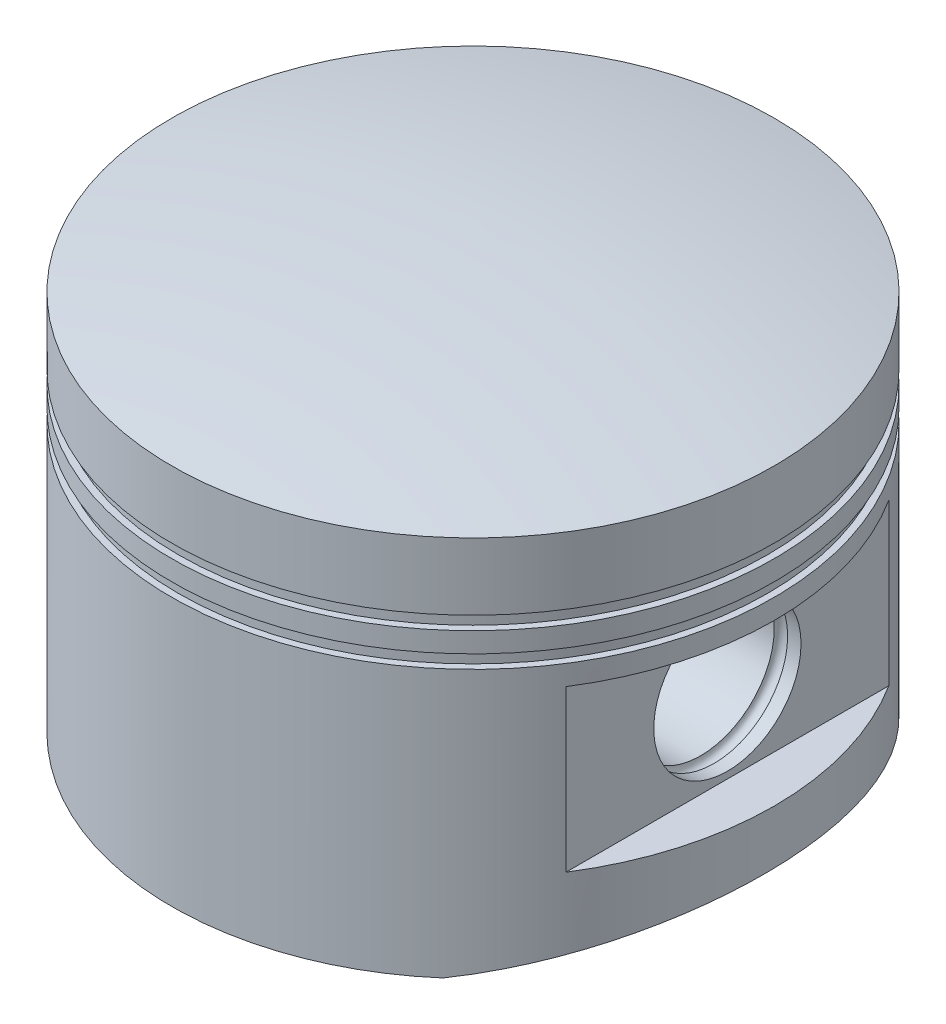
ISO-10303-21;
HEADER;
FILE_DESCRIPTION(('STEP AP214'),'2;1');
FILE_NAME('part.step','',(''),(''),'','','');
FILE_SCHEMA(('AUTOMOTIVE_DESIGN { 1 0 10303 214 1 1 1 1 }'));
ENDSEC;
DATA;
#1=APPLICATION_CONTEXT('core data for automotive mechanical design processes');
#2=APPLICATION_PROTOCOL_DEFINITION('international standard','automotive_design',2000,#1);
#3=PRODUCT_CONTEXT('',#1,'mechanical');
#4=PRODUCT('Part','Part','',(#3));
#5=PRODUCT_RELATED_PRODUCT_CATEGORY('part','',(#4));
#6=PRODUCT_DEFINITION_FORMATION('','',#4);
#7=PRODUCT_DEFINITION_CONTEXT('part definition',#1,'design');
#8=PRODUCT_DEFINITION('design','',#6,#7);
#9=PRODUCT_DEFINITION_SHAPE('','',#8);
#10=(LENGTH_UNIT() NAMED_UNIT(*) SI_UNIT(.MILLI.,.METRE.));
#11=(NAMED_UNIT(*) PLANE_ANGLE_UNIT() SI_UNIT($,.RADIAN.));
#12=(NAMED_UNIT(*) SI_UNIT($,.STERADIAN.) SOLID_ANGLE_UNIT());
#13=UNCERTAINTY_MEASURE_WITH_UNIT(LENGTH_MEASURE(1.E-05),#10,'distance_accuracy_value','');
#14=(GEOMETRIC_REPRESENTATION_CONTEXT(3) GLOBAL_UNCERTAINTY_ASSIGNED_CONTEXT((#13)) GLOBAL_UNIT_ASSIGNED_CONTEXT((#10,
#11,#12)) REPRESENTATION_CONTEXT('',''));
#15=CARTESIAN_POINT('',(0.,0.,0.));
#16=DIRECTION('',(0.,0.,1.));
#17=DIRECTION('',(1.,0.,0.));
#18=AXIS2_PLACEMENT_3D('',#15,#16,#17);
#19=CARTESIAN_POINT('',(-70.,-1.38979352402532,0.));
#20=DIRECTION('',(1.,0.,0.));
#21=DIRECTION('',(0.,0.,-1.));
#22=AXIS2_PLACEMENT_3D('',#19,#20,#21);
#23=CYLINDRICAL_SURFACE('',#22,11.);
#24=CARTESIAN_POINT('',(20.,-1.38979352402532,0.));
#25=DIRECTION('',(-1.,0.,0.));
#26=DIRECTION('',(0.,0.,1.));
#27=AXIS2_PLACEMENT_3D('',#24,#25,#26);
#28=CIRCLE('',#27,11.);
#29=CARTESIAN_POINT('',(20.,-1.38979352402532,11.));
#30=VERTEX_POINT('',#29);
#31=EDGE_CURVE('E289',#30,#30,#28,.T.);
#32=ORIENTED_EDGE('',*,*,#31,.T.);
#33=EDGE_LOOP('',(#32));
#34=FACE_BOUND('',#33,.T.);
#35=CARTESIAN_POINT('',(34.,-1.38979352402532,0.));
#36=DIRECTION('',(1.,0.,0.));
#37=DIRECTION('',(0.,0.,-1.));
#38=AXIS2_PLACEMENT_3D('',#35,#36,#37);
#39=CIRCLE('',#38,11.);
#40=CARTESIAN_POINT('',(34.,-1.38979352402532,-11.));
#41=VERTEX_POINT('',#40);
#42=EDGE_CURVE('E36',#41,#41,#39,.F.);
#43=ORIENTED_EDGE('',*,*,#42,.F.);
#44=EDGE_LOOP('',(#43));
#45=FACE_BOUND('',#44,.T.);
#46=ADVANCED_FACE('F32',(#34,#45),#23,.F.);
#47=CARTESIAN_POINT('',(38.,-1.38979352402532,0.));
#48=DIRECTION('',(1.,0.,0.));
#49=DIRECTION('',(0.,0.,-1.));
#50=AXIS2_PLACEMENT_3D('',#47,#48,#49);
#51=CIRCLE('',#50,11.);
#52=CARTESIAN_POINT('',(38.,-1.38979352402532,-11.));
#53=VERTEX_POINT('',#52);
#54=EDGE_CURVE('E293',#53,#53,#51,.T.);
#55=ORIENTED_EDGE('',*,*,#54,.T.);
#56=EDGE_LOOP('',(#55));
#57=FACE_BOUND('',#56,.T.);
#58=CARTESIAN_POINT('',(36.,-1.38979352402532,0.));
#59=DIRECTION('',(-1.,0.,0.));
#60=DIRECTION('',(0.,0.,1.));
#61=AXIS2_PLACEMENT_3D('',#58,#59,#60);
#62=CIRCLE('',#61,11.);
#63=CARTESIAN_POINT('',(36.,-1.38979352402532,11.));
#64=VERTEX_POINT('',#63);
#65=EDGE_CURVE('E477',#64,#64,#62,.F.);
#66=ORIENTED_EDGE('',*,*,#65,.F.);
#67=EDGE_LOOP('',(#66));
#68=FACE_BOUND('',#67,.T.);
#69=ADVANCED_FACE('F449',(#57,#68),#23,.F.);
#70=CARTESIAN_POINT('',(-38.,-1.38979352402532,0.));
#71=DIRECTION('',(1.,0.,0.));
#72=DIRECTION('',(0.,0.,-1.));
#73=AXIS2_PLACEMENT_3D('',#70,#71,#72);
#74=CIRCLE('',#73,11.);
#75=CARTESIAN_POINT('',(-38.,-1.38979352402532,-11.));
#76=VERTEX_POINT('',#75);
#77=EDGE_CURVE('E906',#76,#76,#74,.T.);
#78=ORIENTED_EDGE('',*,*,#77,.F.);
#79=EDGE_LOOP('',(#78));
#80=FACE_BOUND('',#79,.T.);
#81=CARTESIAN_POINT('',(-36.,-1.38979352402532,0.));
#82=DIRECTION('',(1.,0.,0.));
#83=DIRECTION('',(0.,0.,-1.));
#84=AXIS2_PLACEMENT_3D('',#81,#82,#83);
#85=CIRCLE('',#84,11.);
#86=CARTESIAN_POINT('',(-36.,-1.38979352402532,-11.));
#87=VERTEX_POINT('',#86);
#88=EDGE_CURVE('E214',#87,#87,#85,.F.);
#89=ORIENTED_EDGE('',*,*,#88,.F.);
#90=EDGE_LOOP('',(#89));
#91=FACE_BOUND('',#90,.T.);
#92=ADVANCED_FACE('F455',(#80,#91),#23,.F.);
#93=CARTESIAN_POINT('',(-20.,-1.38979352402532,0.));
#94=DIRECTION('',(1.,0.,0.));
#95=DIRECTION('',(0.,0.,-1.));
#96=AXIS2_PLACEMENT_3D('',#93,#94,#95);
#97=CIRCLE('',#96,11.);
#98=CARTESIAN_POINT('',(-20.,-1.38979352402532,-11.));
#99=VERTEX_POINT('',#98);
#100=EDGE_CURVE('E292',#99,#99,#97,.T.);
#101=ORIENTED_EDGE('',*,*,#100,.T.);
#102=EDGE_LOOP('',(#101));
#103=FACE_BOUND('',#102,.T.);
#104=CARTESIAN_POINT('',(-34.,-1.38979352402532,0.));
#105=DIRECTION('',(-1.,0.,0.));
#106=DIRECTION('',(0.,0.,1.));
#107=AXIS2_PLACEMENT_3D('',#104,#105,#106);
#108=CIRCLE('',#107,11.);
#109=CARTESIAN_POINT('',(-34.,-1.38979352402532,11.));
#110=VERTEX_POINT('',#109);
#111=EDGE_CURVE('E472',#110,#110,#108,.F.);
#112=ORIENTED_EDGE('',*,*,#111,.F.);
#113=EDGE_LOOP('',(#112));
#114=FACE_BOUND('',#113,.T.);
#115=ADVANCED_FACE('F451',(#103,#114),#23,.F.);
#116=CARTESIAN_POINT('',(45.,-26.3897935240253,0.));
#117=DIRECTION('',(0.,1.,0.));
#118=DIRECTION('',(0.,0.,1.));
#119=AXIS2_PLACEMENT_3D('',#116,#117,#118);
#120=PLANE('',#119);
#121=CARTESIAN_POINT('',(0.,-26.3897935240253,0.));
#122=DIRECTION('',(0.,-1.,0.));
#123=DIRECTION('',(0.,0.,-1.));
#124=AXIS2_PLACEMENT_3D('',#121,#122,#123);
#125=CIRCLE('',#124,45.);
#126=CARTESIAN_POINT('',(29.498603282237,-26.3897935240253,33.982825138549));
#127=VERTEX_POINT('',#126);
#128=CARTESIAN_POINT('',(-29.498603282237,-26.3897935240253,33.982825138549));
#129=VERTEX_POINT('',#128);
#130=EDGE_CURVE('E218',#127,#129,#125,.T.);
#131=ORIENTED_EDGE('',*,*,#130,.T.);
#132=DIRECTION('',(1.,0.,0.));
#133=VECTOR('',#132,1.);
#134=CARTESIAN_POINT('',(-54.,-26.3897935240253,33.982825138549));
#135=LINE('',#134,#133);
#136=CARTESIAN_POINT('',(-24.6813207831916,-26.3897935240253,33.982825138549));
#137=VERTEX_POINT('',#136);
#138=EDGE_CURVE('E49',#129,#137,#135,.T.);
#139=ORIENTED_EDGE('',*,*,#138,.T.);
#140=CARTESIAN_POINT('',(0.,-26.3897935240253,0.));
#141=DIRECTION('',(0.,-1.,0.));
#142=DIRECTION('',(0.,0.,-1.));
#143=AXIS2_PLACEMENT_3D('',#140,#141,#142);
#144=CIRCLE('',#143,42.);
#145=CARTESIAN_POINT('',(24.6813207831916,-26.3897935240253,33.982825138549));
#146=VERTEX_POINT('',#145);
#147=EDGE_CURVE('E227',#146,#137,#144,.T.);
#148=ORIENTED_EDGE('',*,*,#147,.F.);
#149=EDGE_CURVE('E977',#146,#127,#135,.T.);
#150=ORIENTED_EDGE('',*,*,#149,.T.);
#151=EDGE_LOOP('',(#131,#139,#148,#150));
#152=FACE_BOUND('',#151,.T.);
#153=ADVANCED_FACE('F459',(#152),#120,.F.);
#154=CARTESIAN_POINT('',(30.,66.4850284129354,21.6564078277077));
#155=DIRECTION('',(-1.,0.,0.));
#156=DIRECTION('',(0.,0.,1.));
#157=AXIS2_PLACEMENT_3D('',#154,#155,#156);
#158=PLANE('',#157);
#159=DIRECTION('',(0.,-1.,0.));
#160=VECTOR('',#159,1.);
#161=CARTESIAN_POINT('',(30.,0.,16.3897935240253));
#162=LINE('',#161,#160);
#163=CARTESIAN_POINT('',(30.,22.6102064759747,16.3897935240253));
#164=VERTEX_POINT('',#163);
#165=CARTESIAN_POINT('',(30.,0.,16.3897935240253));
#166=VERTEX_POINT('',#165);
#167=EDGE_CURVE('E901',#164,#166,#162,.T.);
#168=ORIENTED_EDGE('',*,*,#167,.T.);
#169=CARTESIAN_POINT('',(30.,0.,0.));
#170=DIRECTION('',(1.,0.,0.));
#171=DIRECTION('',(0.,0.,-1.));
#172=AXIS2_PLACEMENT_3D('',#169,#170,#171);
#173=CIRCLE('',#172,16.3897935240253);
#174=CARTESIAN_POINT('',(30.,-16.3897935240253,0.));
#175=VERTEX_POINT('',#174);
#176=EDGE_CURVE('E904',#166,#175,#173,.T.);
#177=ORIENTED_EDGE('',*,*,#176,.T.);
#178=DIRECTION('',(0.,0.,-1.));
#179=VECTOR('',#178,1.);
#180=CARTESIAN_POINT('',(30.,-16.3897935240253,21.6564078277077));
#181=LINE('',#180,#179);
#182=CARTESIAN_POINT('',(30.,-16.3897935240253,21.6564078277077));
#183=VERTEX_POINT('',#182);
#184=EDGE_CURVE('E852',#183,#175,#181,.T.);
#185=ORIENTED_EDGE('',*,*,#184,.F.);
#186=DIRECTION('',(0.,-1.,0.));
#187=VECTOR('',#186,1.);
#188=CARTESIAN_POINT('',(30.,66.4850284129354,21.6564078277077));
#189=LINE('',#188,#187);
#190=CARTESIAN_POINT('',(30.,22.6102064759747,21.6564078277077));
#191=VERTEX_POINT('',#190);
#192=EDGE_CURVE('E840',#191,#183,#189,.T.);
#193=ORIENTED_EDGE('',*,*,#192,.F.);
#194=DIRECTION('',(0.,0.,-1.));
#195=VECTOR('',#194,1.);
#196=CARTESIAN_POINT('',(30.,22.6102064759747,21.6564078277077));
#197=LINE('',#196,#195);
#198=EDGE_CURVE('E848',#191,#164,#197,.T.);
#199=ORIENTED_EDGE('',*,*,#198,.T.);
#200=EDGE_LOOP('',(#168,#177,#185,#193,#199));
#201=FACE_BOUND('',#200,.T.);
#202=ADVANCED_FACE('F392',(#201),#158,.T.);
#203=CARTESIAN_POINT('',(37.,22.6102064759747,0.));
#204=DIRECTION('',(0.,1.,0.));
#205=DIRECTION('',(0.,0.,1.));
#206=AXIS2_PLACEMENT_3D('',#203,#204,#205);
#207=PLANE('',#206);
#208=DIRECTION('',(1.,0.,0.));
#209=VECTOR('',#208,1.);
#210=CARTESIAN_POINT('',(20.,22.6102064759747,-16.3897935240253));
#211=LINE('',#210,#209);
#212=CARTESIAN_POINT('',(22.,22.6102064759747,-16.3897935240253));
#213=VERTEX_POINT('',#212);
#214=CARTESIAN_POINT('',(30.,22.6102064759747,-16.3897935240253));
#215=VERTEX_POINT('',#214);
#216=EDGE_CURVE('E893',#213,#215,#211,.T.);
#217=ORIENTED_EDGE('',*,*,#216,.F.);
#218=CARTESIAN_POINT('',(22.,22.6102064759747,-14.3897935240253));
#219=DIRECTION('',(0.,1.,0.));
#220=DIRECTION('',(0.,0.,1.));
#221=AXIS2_PLACEMENT_3D('',#218,#219,#220);
#222=CIRCLE('',#221,2.);
#223=CARTESIAN_POINT('',(20.,22.6102064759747,-14.3897935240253));
#224=VERTEX_POINT('',#223);
#225=EDGE_CURVE('E321',#213,#224,#222,.T.);
#226=ORIENTED_EDGE('',*,*,#225,.T.);
#227=DIRECTION('',(0.,0.,1.));
#228=VECTOR('',#227,1.);
#229=CARTESIAN_POINT('',(20.,22.6102064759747,-16.3897935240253));
#230=LINE('',#229,#228);
#231=CARTESIAN_POINT('',(20.,22.6102064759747,14.3897935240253));
#232=VERTEX_POINT('',#231);
#233=EDGE_CURVE('E897',#224,#232,#230,.T.);
#234=ORIENTED_EDGE('',*,*,#233,.T.);
#235=CARTESIAN_POINT('',(22.,22.6102064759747,14.3897935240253));
#236=DIRECTION('',(0.,1.,0.));
#237=DIRECTION('',(0.,0.,1.));
#238=AXIS2_PLACEMENT_3D('',#235,#236,#237);
#239=CIRCLE('',#238,2.);
#240=CARTESIAN_POINT('',(22.,22.6102064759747,16.3897935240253));
#241=VERTEX_POINT('',#240);
#242=EDGE_CURVE('E319',#232,#241,#239,.T.);
#243=ORIENTED_EDGE('',*,*,#242,.T.);
#244=DIRECTION('',(1.,0.,0.));
#245=VECTOR('',#244,1.);
#246=CARTESIAN_POINT('',(20.,22.6102064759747,16.3897935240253));
#247=LINE('',#246,#245);
#248=EDGE_CURVE('E891',#241,#164,#247,.T.);
#249=ORIENTED_EDGE('',*,*,#248,.T.);
#250=ORIENTED_EDGE('',*,*,#198,.F.);
#251=CARTESIAN_POINT('',(0.,22.6102064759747,0.));
#252=DIRECTION('',(0.,-1.,0.));
#253=DIRECTION('',(0.,0.,-1.));
#254=AXIS2_PLACEMENT_3D('',#251,#252,#253);
#255=CIRCLE('',#254,37.);
#256=CARTESIAN_POINT('',(-30.,22.6102064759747,21.6564078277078));
#257=VERTEX_POINT('',#256);
#258=EDGE_CURVE('E236',#191,#257,#255,.T.);
#259=ORIENTED_EDGE('',*,*,#258,.T.);
#260=DIRECTION('',(0.,0.,1.));
#261=VECTOR('',#260,1.);
#262=CARTESIAN_POINT('',(-30.,22.6102064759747,21.6564078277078));
#263=LINE('',#262,#261);
#264=CARTESIAN_POINT('',(-30.,22.6102064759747,16.3897935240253));
#265=VERTEX_POINT('',#264);
#266=EDGE_CURVE('E865',#265,#257,#263,.T.);
#267=ORIENTED_EDGE('',*,*,#266,.F.);
#268=DIRECTION('',(-1.,0.,0.));
#269=VECTOR('',#268,1.);
#270=CARTESIAN_POINT('',(-20.,22.6102064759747,16.3897935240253));
#271=LINE('',#270,#269);
#272=CARTESIAN_POINT('',(-22.,22.6102064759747,16.3897935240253));
#273=VERTEX_POINT('',#272);
#274=EDGE_CURVE('E874',#273,#265,#271,.T.);
#275=ORIENTED_EDGE('',*,*,#274,.F.);
#276=CARTESIAN_POINT('',(-22.,22.6102064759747,14.3897935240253));
#277=DIRECTION('',(0.,1.,0.));
#278=DIRECTION('',(0.,0.,1.));
#279=AXIS2_PLACEMENT_3D('',#276,#277,#278);
#280=CIRCLE('',#279,2.);
#281=CARTESIAN_POINT('',(-20.,22.6102064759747,14.3897935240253));
#282=VERTEX_POINT('',#281);
#283=EDGE_CURVE('E323',#273,#282,#280,.T.);
#284=ORIENTED_EDGE('',*,*,#283,.T.);
#285=DIRECTION('',(0.,0.,1.));
#286=VECTOR('',#285,1.);
#287=CARTESIAN_POINT('',(-20.,22.6102064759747,-16.3897935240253));
#288=LINE('',#287,#286);
#289=CARTESIAN_POINT('',(-20.,22.6102064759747,-14.3897935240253));
#290=VERTEX_POINT('',#289);
#291=EDGE_CURVE('E878',#290,#282,#288,.T.);
#292=ORIENTED_EDGE('',*,*,#291,.F.);
#293=CARTESIAN_POINT('',(-22.,22.6102064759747,-14.3897935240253));
#294=DIRECTION('',(0.,1.,0.));
#295=DIRECTION('',(0.,0.,1.));
#296=AXIS2_PLACEMENT_3D('',#293,#294,#295);
#297=CIRCLE('',#296,2.);
#298=CARTESIAN_POINT('',(-22.,22.6102064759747,-16.3897935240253));
#299=VERTEX_POINT('',#298);
#300=EDGE_CURVE('E205',#290,#299,#297,.T.);
#301=ORIENTED_EDGE('',*,*,#300,.T.);
#302=DIRECTION('',(-1.,0.,0.));
#303=VECTOR('',#302,1.);
#304=CARTESIAN_POINT('',(-20.,22.6102064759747,-16.3897935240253));
#305=LINE('',#304,#303);
#306=CARTESIAN_POINT('',(-30.,22.6102064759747,-16.3897935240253));
#307=VERTEX_POINT('',#306);
#308=EDGE_CURVE('E872',#299,#307,#305,.T.);
#309=ORIENTED_EDGE('',*,*,#308,.T.);
#310=CARTESIAN_POINT('',(-30.,22.6102064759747,-21.6564078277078));
#311=VERTEX_POINT('',#310);
#312=EDGE_CURVE('E862',#311,#307,#263,.T.);
#313=ORIENTED_EDGE('',*,*,#312,.F.);
#314=CARTESIAN_POINT('',(30.,22.6102064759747,-21.6564078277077));
#315=VERTEX_POINT('',#314);
#316=EDGE_CURVE('E235',#311,#315,#255,.T.);
#317=ORIENTED_EDGE('',*,*,#316,.T.);
#318=EDGE_CURVE('E851',#215,#315,#197,.T.);
#319=ORIENTED_EDGE('',*,*,#318,.F.);
#320=EDGE_LOOP('',(#217,#226,#234,#243,#249,#250,#259,#267,#275,#284,#292,#301,#309,#313,#317,#319));
#321=FACE_BOUND('',#320,.T.);
#322=ADVANCED_FACE('F388',(#321),#207,.F.);
#323=CARTESIAN_POINT('',(-30.,66.4850284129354,21.6564078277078));
#324=DIRECTION('',(1.,0.,0.));
#325=DIRECTION('',(0.,0.,-1.));
#326=AXIS2_PLACEMENT_3D('',#323,#324,#325);
#327=PLANE('',#326);
#328=ORIENTED_EDGE('',*,*,#312,.T.);
#329=DIRECTION('',(0.,1.,0.));
#330=VECTOR('',#329,1.);
#331=CARTESIAN_POINT('',(-30.,0.,-16.3897935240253));
#332=LINE('',#331,#330);
#333=CARTESIAN_POINT('',(-30.,0.,-16.3897935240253));
#334=VERTEX_POINT('',#333);
#335=EDGE_CURVE('E882',#334,#307,#332,.T.);
#336=ORIENTED_EDGE('',*,*,#335,.F.);
#337=CARTESIAN_POINT('',(-30.,0.,0.));
#338=DIRECTION('',(1.,0.,0.));
#339=DIRECTION('',(0.,0.,-1.));
#340=AXIS2_PLACEMENT_3D('',#337,#338,#339);
#341=CIRCLE('',#340,16.3897935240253);
#342=CARTESIAN_POINT('',(-30.,-16.3897935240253,0.));
#343=VERTEX_POINT('',#342);
#344=EDGE_CURVE('E282',#334,#343,#341,.F.);
#345=ORIENTED_EDGE('',*,*,#344,.T.);
#346=DIRECTION('',(0.,0.,1.));
#347=VECTOR('',#346,1.);
#348=CARTESIAN_POINT('',(-30.,-16.3897935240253,21.6564078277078));
#349=LINE('',#348,#347);
#350=CARTESIAN_POINT('',(-30.,-16.3897935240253,-21.6564078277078));
#351=VERTEX_POINT('',#350);
#352=EDGE_CURVE('E866',#351,#343,#349,.T.);
#353=ORIENTED_EDGE('',*,*,#352,.F.);
#354=DIRECTION('',(0.,-1.,0.));
#355=VECTOR('',#354,1.);
#356=CARTESIAN_POINT('',(-30.,66.4850284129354,-21.6564078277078));
#357=LINE('',#356,#355);
#358=EDGE_CURVE('E856',#311,#351,#357,.T.);
#359=ORIENTED_EDGE('',*,*,#358,.F.);
#360=EDGE_LOOP('',(#328,#336,#345,#353,#359));
#361=FACE_BOUND('',#360,.T.);
#362=ADVANCED_FACE('F391',(#361),#327,.T.);
#363=CARTESIAN_POINT('',(-30.,-16.3897935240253,21.6564078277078));
#364=VERTEX_POINT('',#363);
#365=EDGE_CURVE('E869',#343,#364,#349,.T.);
#366=ORIENTED_EDGE('',*,*,#365,.F.);
#367=CARTESIAN_POINT('',(-30.,0.,0.));
#368=DIRECTION('',(1.,0.,0.));
#369=DIRECTION('',(0.,0.,-1.));
#370=AXIS2_PLACEMENT_3D('',#367,#368,#369);
#371=CIRCLE('',#370,16.3897935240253);
#372=CARTESIAN_POINT('',(-30.,0.,16.3897935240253));
#373=VERTEX_POINT('',#372);
#374=EDGE_CURVE('E885',#373,#343,#371,.T.);
#375=ORIENTED_EDGE('',*,*,#374,.F.);
#376=DIRECTION('',(0.,-1.,0.));
#377=VECTOR('',#376,1.);
#378=CARTESIAN_POINT('',(-30.,0.,16.3897935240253));
#379=LINE('',#378,#377);
#380=EDGE_CURVE('E879',#265,#373,#379,.T.);
#381=ORIENTED_EDGE('',*,*,#380,.F.);
#382=ORIENTED_EDGE('',*,*,#266,.T.);
#383=DIRECTION('',(0.,-1.,0.));
#384=VECTOR('',#383,1.);
#385=CARTESIAN_POINT('',(-30.,66.4850284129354,21.6564078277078));
#386=LINE('',#385,#384);
#387=EDGE_CURVE('E859',#257,#364,#386,.T.);
#388=ORIENTED_EDGE('',*,*,#387,.T.);
#389=EDGE_LOOP('',(#366,#375,#381,#382,#388));
#390=FACE_BOUND('',#389,.T.);
#391=ADVANCED_FACE('F683',(#390),#327,.T.);
#392=CARTESIAN_POINT('',(0.,22.6102064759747,0.));
#393=DIRECTION('',(0.,-1.,0.));
#394=DIRECTION('',(0.,0.,-1.));
#395=AXIS2_PLACEMENT_3D('',#392,#393,#394);
#396=CYLINDRICAL_SURFACE('',#395,37.);
#397=CARTESIAN_POINT('',(0.,-16.3897935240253,0.));
#398=DIRECTION('',(0.,-1.,0.));
#399=DIRECTION('',(0.,0.,-1.));
#400=AXIS2_PLACEMENT_3D('',#397,#398,#399);
#401=CIRCLE('',#400,37.);
#402=EDGE_CURVE('E232',#183,#364,#401,.T.);
#403=ORIENTED_EDGE('',*,*,#402,.T.);
#404=ORIENTED_EDGE('',*,*,#387,.F.);
#405=ORIENTED_EDGE('',*,*,#258,.F.);
#406=ORIENTED_EDGE('',*,*,#192,.T.);
#407=EDGE_LOOP('',(#403,#404,#405,#406));
#408=FACE_BOUND('',#407,.T.);
#409=ADVANCED_FACE('F387',(#408),#396,.F.);
#410=CARTESIAN_POINT('',(0.,22.6102064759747,0.));
#411=DIRECTION('',(0.,-1.,0.));
#412=DIRECTION('',(0.,0.,-1.));
#413=AXIS2_PLACEMENT_3D('',#410,#411,#412);
#414=CYLINDRICAL_SURFACE('',#413,44.);
#415=CARTESIAN_POINT('',(0.,13.6102064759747,0.));
#416=DIRECTION('',(0.,-1.,0.));
#417=DIRECTION('',(0.,0.,-1.));
#418=AXIS2_PLACEMENT_3D('',#415,#416,#417);
#419=CIRCLE('',#418,44.);
#420=CARTESIAN_POINT('',(0.,13.6102064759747,-44.));
#421=VERTEX_POINT('',#420);
#422=EDGE_CURVE('E222',#421,#421,#419,.T.);
#423=ORIENTED_EDGE('',*,*,#422,.F.);
#424=EDGE_LOOP('',(#423));
#425=FACE_BOUND('',#424,.T.);
#426=CARTESIAN_POINT('',(0.,15.6102064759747,0.));
#427=DIRECTION('',(0.,-1.,0.));
#428=DIRECTION('',(0.,0.,-1.));
#429=AXIS2_PLACEMENT_3D('',#426,#427,#428);
#430=CIRCLE('',#429,44.);
#431=CARTESIAN_POINT('',(0.,15.6102064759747,-44.));
#432=VERTEX_POINT('',#431);
#433=EDGE_CURVE('E255',#432,#432,#430,.T.);
#434=ORIENTED_EDGE('',*,*,#433,.T.);
#435=EDGE_LOOP('',(#434));
#436=FACE_BOUND('',#435,.T.);
#437=ADVANCED_FACE('F417',(#425,#436),#414,.T.);
#438=CARTESIAN_POINT('',(44.,15.6102064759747,0.));
#439=DIRECTION('',(0.,-1.,0.));
#440=DIRECTION('',(0.,0.,-1.));
#441=AXIS2_PLACEMENT_3D('',#438,#439,#440);
#442=PLANE('',#441);
#443=CARTESIAN_POINT('',(0.,15.6102064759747,0.));
#444=DIRECTION('',(0.,-1.,0.));
#445=DIRECTION('',(0.,0.,-1.));
#446=AXIS2_PLACEMENT_3D('',#443,#444,#445);
#447=CIRCLE('',#446,45.);
#448=CARTESIAN_POINT('',(0.,15.6102064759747,-45.));
#449=VERTEX_POINT('',#448);
#450=EDGE_CURVE('E252',#449,#449,#447,.T.);
#451=ORIENTED_EDGE('',*,*,#450,.T.);
#452=EDGE_LOOP('',(#451));
#453=FACE_BOUND('',#452,.T.);
#454=ORIENTED_EDGE('',*,*,#433,.F.);
#455=EDGE_LOOP('',(#454));
#456=FACE_BOUND('',#455,.T.);
#457=ADVANCED_FACE('F413',(#453,#456),#442,.T.);
#458=CARTESIAN_POINT('',(0.,22.6102064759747,0.));
#459=DIRECTION('',(0.,-1.,0.));
#460=DIRECTION('',(0.,0.,-1.));
#461=AXIS2_PLACEMENT_3D('',#458,#459,#460);
#462=CYLINDRICAL_SURFACE('',#461,45.);
#463=CARTESIAN_POINT('',(0.,18.6102064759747,0.));
#464=DIRECTION('',(0.,-1.,0.));
#465=DIRECTION('',(0.,0.,-1.));
#466=AXIS2_PLACEMENT_3D('',#463,#464,#465);
#467=CIRCLE('',#466,45.);
#468=CARTESIAN_POINT('',(0.,18.6102064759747,-45.));
#469=VERTEX_POINT('',#468);
#470=EDGE_CURVE('E249',#469,#469,#467,.T.);
#471=ORIENTED_EDGE('',*,*,#470,.T.);
#472=EDGE_LOOP('',(#471));
#473=FACE_BOUND('',#472,.T.);
#474=ORIENTED_EDGE('',*,*,#450,.F.);
#475=EDGE_LOOP('',(#474));
#476=FACE_BOUND('',#475,.T.);
#477=ADVANCED_FACE('F409',(#473,#476),#462,.T.);
#478=CARTESIAN_POINT('',(45.,18.6102064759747,0.));
#479=DIRECTION('',(0.,1.,0.));
#480=DIRECTION('',(0.,0.,1.));
#481=AXIS2_PLACEMENT_3D('',#478,#479,#480);
#482=PLANE('',#481);
#483=CARTESIAN_POINT('',(0.,18.6102064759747,0.));
#484=DIRECTION('',(0.,-1.,0.));
#485=DIRECTION('',(0.,0.,-1.));
#486=AXIS2_PLACEMENT_3D('',#483,#484,#485);
#487=CIRCLE('',#486,44.);
#488=CARTESIAN_POINT('',(0.,18.6102064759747,-44.));
#489=VERTEX_POINT('',#488);
#490=EDGE_CURVE('E246',#489,#489,#487,.T.);
#491=ORIENTED_EDGE('',*,*,#490,.T.);
#492=EDGE_LOOP('',(#491));
#493=FACE_BOUND('',#492,.T.);
#494=ORIENTED_EDGE('',*,*,#470,.F.);
#495=EDGE_LOOP('',(#494));
#496=FACE_BOUND('',#495,.T.);
#497=ADVANCED_FACE('F405',(#493,#496),#482,.T.);
#498=CARTESIAN_POINT('',(0.,22.6102064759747,0.));
#499=DIRECTION('',(0.,-1.,0.));
#500=DIRECTION('',(0.,0.,-1.));
#501=AXIS2_PLACEMENT_3D('',#498,#499,#500);
#502=CYLINDRICAL_SURFACE('',#501,44.);
#503=ORIENTED_EDGE('',*,*,#490,.F.);
#504=EDGE_LOOP('',(#503));
#505=FACE_BOUND('',#504,.T.);
#506=CARTESIAN_POINT('',(0.,20.6102064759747,0.));
#507=DIRECTION('',(0.,-1.,0.));
#508=DIRECTION('',(0.,0.,-1.));
#509=AXIS2_PLACEMENT_3D('',#506,#507,#508);
#510=CIRCLE('',#509,44.);
#511=CARTESIAN_POINT('',(0.,20.6102064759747,-44.));
#512=VERTEX_POINT('',#511);
#513=EDGE_CURVE('E243',#512,#512,#510,.T.);
#514=ORIENTED_EDGE('',*,*,#513,.T.);
#515=EDGE_LOOP('',(#514));
#516=FACE_BOUND('',#515,.T.);
#517=ADVANCED_FACE('F401',(#505,#516),#502,.T.);
#518=CARTESIAN_POINT('',(45.,20.6102064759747,0.));
#519=DIRECTION('',(0.,1.,0.));
#520=DIRECTION('',(0.,0.,1.));
#521=AXIS2_PLACEMENT_3D('',#518,#519,#520);
#522=PLANE('',#521);
#523=ORIENTED_EDGE('',*,*,#513,.F.);
#524=EDGE_LOOP('',(#523));
#525=FACE_BOUND('',#524,.T.);
#526=CARTESIAN_POINT('',(0.,20.6102064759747,0.));
#527=DIRECTION('',(0.,-1.,0.));
#528=DIRECTION('',(0.,0.,-1.));
#529=AXIS2_PLACEMENT_3D('',#526,#527,#528);
#530=CIRCLE('',#529,45.);
#531=CARTESIAN_POINT('',(0.,20.6102064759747,-45.));
#532=VERTEX_POINT('',#531);
#533=EDGE_CURVE('E240',#532,#532,#530,.T.);
#534=ORIENTED_EDGE('',*,*,#533,.T.);
#535=EDGE_LOOP('',(#534));
#536=FACE_BOUND('',#535,.T.);
#537=ADVANCED_FACE('F397',(#525,#536),#522,.F.);
#538=CARTESIAN_POINT('',(0.,22.6102064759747,0.));
#539=DIRECTION('',(0.,-1.,0.));
#540=DIRECTION('',(0.,0.,-1.));
#541=AXIS2_PLACEMENT_3D('',#538,#539,#540);
#542=CYLINDRICAL_SURFACE('',#541,45.);
#543=CARTESIAN_POINT('',(0.,30.6102064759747,0.));
#544=DIRECTION('',(0.,-1.,0.));
#545=DIRECTION('',(0.,0.,-1.));
#546=AXIS2_PLACEMENT_3D('',#543,#544,#545);
#547=CIRCLE('',#546,45.);
#548=CARTESIAN_POINT('',(0.,30.6102064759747,-45.));
#549=VERTEX_POINT('',#548);
#550=EDGE_CURVE('E239',#549,#549,#547,.T.);
#551=ORIENTED_EDGE('',*,*,#550,.T.);
#552=EDGE_LOOP('',(#551));
#553=FACE_BOUND('',#552,.T.);
#554=ORIENTED_EDGE('',*,*,#533,.F.);
#555=EDGE_LOOP('',(#554));
#556=FACE_BOUND('',#555,.T.);
#557=ADVANCED_FACE('F394',(#553,#556),#542,.T.);
#558=CARTESIAN_POINT('',(0.,-169.389793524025,0.));
#559=DIRECTION('',(0.,0.,1.));
#560=DIRECTION('',(1.,0.,0.));
#561=AXIS2_PLACEMENT_3D('',#558,#559,#560);
#562=SPHERICAL_SURFACE('',#561,205.);
#563=CARTESIAN_POINT('',(0.,-169.389793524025,0.));
#564=DIRECTION('',(0.,-1.,0.));
#565=DIRECTION('',(0.,0.,-1.));
#566=AXIS2_PLACEMENT_3D('',#563,#564,#565);
#567=SPHERICAL_SURFACE('',#566,205.);
#568=ORIENTED_EDGE('',*,*,#550,.F.);
#569=EDGE_LOOP('',(#568));
#570=FACE_BOUND('',#569,.T.);
#571=ADVANCED_FACE('F34',(#570),#567,.T.);
#572=ORIENTED_EDGE('',*,*,#316,.F.);
#573=ORIENTED_EDGE('',*,*,#358,.T.);
#574=CARTESIAN_POINT('',(30.,-16.3897935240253,-21.6564078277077));
#575=VERTEX_POINT('',#574);
#576=EDGE_CURVE('E231',#351,#575,#401,.T.);
#577=ORIENTED_EDGE('',*,*,#576,.T.);
#578=DIRECTION('',(0.,-1.,0.));
#579=VECTOR('',#578,1.);
#580=CARTESIAN_POINT('',(30.,66.4850284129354,-21.6564078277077));
#581=LINE('',#580,#579);
#582=EDGE_CURVE('E845',#315,#575,#581,.T.);
#583=ORIENTED_EDGE('',*,*,#582,.F.);
#584=EDGE_LOOP('',(#572,#573,#577,#583));
#585=FACE_BOUND('',#584,.T.);
#586=ADVANCED_FACE('F382',(#585),#396,.F.);
#587=CARTESIAN_POINT('',(42.,-16.3897935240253,0.));
#588=DIRECTION('',(0.,1.,0.));
#589=DIRECTION('',(0.,0.,1.));
#590=AXIS2_PLACEMENT_3D('',#587,#588,#589);
#591=PLANE('',#590);
#592=ORIENTED_EDGE('',*,*,#402,.F.);
#593=ORIENTED_EDGE('',*,*,#184,.T.);
#594=EDGE_CURVE('E855',#175,#575,#181,.T.);
#595=ORIENTED_EDGE('',*,*,#594,.T.);
#596=ORIENTED_EDGE('',*,*,#576,.F.);
#597=ORIENTED_EDGE('',*,*,#352,.T.);
#598=ORIENTED_EDGE('',*,*,#365,.T.);
#599=EDGE_LOOP('',(#592,#593,#595,#596,#597,#598));
#600=FACE_BOUND('',#599,.T.);
#601=CARTESIAN_POINT('',(0.,-16.3897935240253,0.));
#602=DIRECTION('',(0.,-1.,0.));
#603=DIRECTION('',(0.,0.,-1.));
#604=AXIS2_PLACEMENT_3D('',#601,#602,#603);
#605=CIRCLE('',#604,42.);
#606=CARTESIAN_POINT('',(0.,-16.3897935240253,-42.));
#607=VERTEX_POINT('',#606);
#608=EDGE_CURVE('E228',#607,#607,#605,.T.);
#609=ORIENTED_EDGE('',*,*,#608,.T.);
#610=EDGE_LOOP('',(#609));
#611=FACE_BOUND('',#610,.T.);
#612=ADVANCED_FACE('F377',(#600,#611),#591,.F.);
#613=CARTESIAN_POINT('',(0.,22.6102064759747,0.));
#614=DIRECTION('',(0.,-1.,0.));
#615=DIRECTION('',(0.,0.,-1.));
#616=AXIS2_PLACEMENT_3D('',#613,#614,#615);
#617=CYLINDRICAL_SURFACE('',#616,42.);
#618=ORIENTED_EDGE('',*,*,#608,.F.);
#619=EDGE_LOOP('',(#618));
#620=FACE_BOUND('',#619,.T.);
#621=ORIENTED_EDGE('',*,*,#147,.T.);
#622=CARTESIAN_POINT('',(-24.6813207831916,-26.3897935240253,33.982825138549));
#623=CARTESIAN_POINT('',(-25.1633117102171,-26.2936401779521,33.6327576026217));
#624=CARTESIAN_POINT('',(-25.637624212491,-26.1961798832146,33.2726077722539));
#625=CARTESIAN_POINT('',(-26.5702585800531,-25.9992886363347,32.5326881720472));
#626=CARTESIAN_POINT('',(-27.0285806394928,-25.8998577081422,32.1529186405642));
#627=CARTESIAN_POINT('',(-28.3784143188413,-25.5996177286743,30.9851689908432));
#628=CARTESIAN_POINT('',(-29.2450226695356,-25.3968152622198,30.1685812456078));
#629=CARTESIAN_POINT('',(-30.9063966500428,-24.9911756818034,28.4642317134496));
#630=CARTESIAN_POINT('',(-31.7011041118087,-24.7883386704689,27.5764133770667));
#631=CARTESIAN_POINT('',(-33.2127996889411,-24.3879944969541,25.7357343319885));
#632=CARTESIAN_POINT('',(-33.9297885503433,-24.1904872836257,24.7828742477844));
#633=CARTESIAN_POINT('',(-35.2815556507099,-23.805692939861,22.8174391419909));
#634=CARTESIAN_POINT('',(-35.9162694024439,-23.6184138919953,21.8048181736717));
#635=CARTESIAN_POINT('',(-37.0981158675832,-23.258989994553,19.7270917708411));
#636=CARTESIAN_POINT('',(-37.6452479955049,-23.0868452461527,18.6619859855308));
#637=CARTESIAN_POINT('',(-38.6471930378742,-22.7621546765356,16.4871739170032));
#638=CARTESIAN_POINT('',(-39.1020670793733,-22.6095959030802,15.3774977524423));
#639=CARTESIAN_POINT('',(-39.9159982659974,-22.327784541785,13.1206662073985));
#640=CARTESIAN_POINT('',(-40.2750580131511,-22.1985313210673,11.9735118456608));
#641=CARTESIAN_POINT('',(-40.887586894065,-21.9689476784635,9.67425233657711));
#642=CARTESIAN_POINT('',(-41.1430935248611,-21.8680724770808,8.52274447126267));
#643=CARTESIAN_POINT('',(-41.5565620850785,-21.6940704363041,6.200263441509));
#644=CARTESIAN_POINT('',(-41.7145250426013,-21.6209433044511,5.02929048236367));
#645=CARTESIAN_POINT('',(-41.9312584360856,-21.5039919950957,2.67674003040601));
#646=CARTESIAN_POINT('',(-41.9900289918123,-21.460167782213,1.49516255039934));
#647=CARTESIAN_POINT('',(-42.0076405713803,-21.4025391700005,-0.869456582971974));
#648=CARTESIAN_POINT('',(-41.9664842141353,-21.3887339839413,-2.05249819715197));
#649=CARTESIAN_POINT('',(-41.7879068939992,-21.3909381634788,-4.36653067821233));
#650=CARTESIAN_POINT('',(-41.6541584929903,-21.4058475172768,-5.49780803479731));
#651=CARTESIAN_POINT('',(-41.2953793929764,-21.4624213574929,-7.74508305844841));
#652=CARTESIAN_POINT('',(-41.0703512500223,-21.5040850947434,-8.86108115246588));
#653=CARTESIAN_POINT('',(-40.5308525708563,-21.6125623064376,-11.0698880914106));
#654=CARTESIAN_POINT('',(-40.2163884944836,-21.679373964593,-12.1626986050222));
#655=CARTESIAN_POINT('',(-39.5005169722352,-21.8359044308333,-14.3177655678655));
#656=CARTESIAN_POINT('',(-39.0991083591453,-21.9256235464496,-15.3800216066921));
#657=CARTESIAN_POINT('',(-38.2109429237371,-22.1255025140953,-17.4704880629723));
#658=CARTESIAN_POINT('',(-37.7239023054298,-22.2357304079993,-18.4985713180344));
#659=CARTESIAN_POINT('',(-36.669008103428,-22.4731191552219,-20.5103363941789));
#660=CARTESIAN_POINT('',(-36.1011543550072,-22.6002800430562,-21.4940181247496));
#661=CARTESIAN_POINT('',(-34.8884113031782,-22.8678939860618,-23.4112328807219));
#662=CARTESIAN_POINT('',(-34.2434961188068,-23.0083515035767,-24.3447489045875));
#663=CARTESIAN_POINT('',(-32.8810768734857,-23.2985449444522,-26.1556639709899));
#664=CARTESIAN_POINT('',(-32.1635720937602,-23.448280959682,-27.0330624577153));
#665=CARTESIAN_POINT('',(-30.6333915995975,-23.7583529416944,-28.7571070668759));
#666=CARTESIAN_POINT('',(-29.8182166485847,-23.9188764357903,-29.6015025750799));
#667=CARTESIAN_POINT('',(-28.1200913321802,-24.2406398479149,-31.2191556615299));
#668=CARTESIAN_POINT('',(-27.2371348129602,-24.4018798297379,-31.9924067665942));
#669=CARTESIAN_POINT('',(-25.4098049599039,-24.7201430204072,-33.4621555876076));
#670=CARTESIAN_POINT('',(-24.4654730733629,-24.877168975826,-34.1587042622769));
#671=CARTESIAN_POINT('',(-22.5209964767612,-25.1823610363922,-35.4708274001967));
#672=CARTESIAN_POINT('',(-21.5208666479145,-25.330529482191,-36.0864233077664));
#673=CARTESIAN_POINT('',(-19.8424278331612,-25.5622485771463,-37.0248485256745));
#674=CARTESIAN_POINT('',(-19.1786772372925,-25.649774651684,-37.3729905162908));
#675=CARTESIAN_POINT('',(-17.8329338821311,-25.8182707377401,-38.0335121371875));
#676=CARTESIAN_POINT('',(-17.1509452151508,-25.8992422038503,-38.345899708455));
#677=CARTESIAN_POINT('',(-15.7712527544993,-26.0535063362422,-38.9336505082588));
#678=CARTESIAN_POINT('',(-15.0735671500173,-26.1268073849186,-39.2090542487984));
#679=CARTESIAN_POINT('',(-13.6635267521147,-26.2649141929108,-39.7224314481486));
#680=CARTESIAN_POINT('',(-12.9511681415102,-26.3297177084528,-39.9603950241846));
#681=CARTESIAN_POINT('',(-12.2325436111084,-26.3897935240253,-40.1791597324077));
#682=B_SPLINE_CURVE_WITH_KNOTS('',3,(#622,#623,#624,#625,#626,#627,#628,#629,#630,#631,#632,
#633,#634,#635,#636,#637,#638,#639,#640,#641,#642,#643,#644,#645,#646,#647,#648,#649,#650,#651,
#652,#653,#654,#655,#656,#657,#658,#659,#660,#661,#662,#663,#664,#665,#666,#667,#668,#669,#670,
#671,#672,#673,#674,#675,#676,#677,#678,#679,#680,#681),.UNSPECIFIED.,.F.,.F.,(4,2,2,2,2,2,2,2,
2,2,2,2,2,2,2,2,2,2,2,2,2,2,2,2,2,2,2,2,2,4),(0.,1.80995690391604,3.61989182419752,
7.23890309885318,10.8608164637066,14.4826950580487,18.1073955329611,21.7321202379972,
25.3544354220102,28.9766522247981,32.5236645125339,36.0706394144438,39.6176100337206,
43.1644876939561,46.5781874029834,49.9917915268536,53.4051491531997,56.8185526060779,
60.2434894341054,63.6684332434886,67.0945305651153,70.5206618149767,74.0703678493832,
77.620396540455,81.1680522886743,84.7147663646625,86.9776006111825,89.2399313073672,
91.4997632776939,93.760190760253),.UNSPECIFIED.);
#683=CARTESIAN_POINT('',(-12.2325436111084,-26.3897935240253,-40.1791597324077));
#684=VERTEX_POINT('',#683);
#685=EDGE_CURVE('E363',#137,#684,#682,.T.);
#686=ORIENTED_EDGE('',*,*,#685,.T.);
#687=CARTESIAN_POINT('',(12.2325436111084,-26.3897935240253,-40.1791597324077));
#688=VERTEX_POINT('',#687);
#689=EDGE_CURVE('E213',#684,#688,#144,.T.);
#690=ORIENTED_EDGE('',*,*,#689,.T.);
#691=CARTESIAN_POINT('',(12.2325436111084,-26.3897935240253,-40.1791597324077));
#692=CARTESIAN_POINT('',(12.7999386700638,-26.3423527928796,-40.0064240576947));
#693=CARTESIAN_POINT('',(13.363433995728,-26.2919728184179,-39.8217275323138));
#694=CARTESIAN_POINT('',(14.4816358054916,-26.185784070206,-39.4288376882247));
#695=CARTESIAN_POINT('',(15.0363425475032,-26.1299754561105,-39.2206450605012));
#696=CARTESIAN_POINT('',(16.1358858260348,-26.0133895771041,-38.7812278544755));
#697=CARTESIAN_POINT('',(16.6807245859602,-25.9526134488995,-38.5500085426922));
#698=CARTESIAN_POINT('',(17.7596868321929,-25.8265829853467,-38.0649903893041));
#699=CARTESIAN_POINT('',(18.293810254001,-25.761328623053,-37.8111914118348));
#700=CARTESIAN_POINT('',(19.8775472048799,-25.5597721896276,-37.0172409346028));
#701=CARTESIAN_POINT('',(20.9100328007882,-25.4175148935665,-36.4439336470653));
#702=CARTESIAN_POINT('',(22.9218174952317,-25.1216237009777,-35.2133681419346));
#703=CARTESIAN_POINT('',(23.9011143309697,-24.9679893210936,-34.5561063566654));
#704=CARTESIAN_POINT('',(25.8000310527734,-24.6540930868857,-33.1624003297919));
#705=CARTESIAN_POINT('',(26.719671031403,-24.4938334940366,-32.4259829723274));
#706=CARTESIAN_POINT('',(28.4936776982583,-24.1714824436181,-30.8787255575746));
#707=CARTESIAN_POINT('',(29.3480447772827,-24.009390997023,-30.0678859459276));
#708=CARTESIAN_POINT('',(30.9860563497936,-23.6882147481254,-28.3769276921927));
#709=CARTESIAN_POINT('',(31.7696929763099,-23.5291302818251,-27.4968013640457));
#710=CARTESIAN_POINT('',(33.260870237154,-23.21876452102,-25.6729818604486));
#711=CARTESIAN_POINT('',(33.9684104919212,-23.0674832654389,-24.7292883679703));
#712=CARTESIAN_POINT('',(35.3099268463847,-22.7756861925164,-22.7734710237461));
#713=CARTESIAN_POINT('',(35.9429864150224,-22.6353105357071,-21.7606970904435));
#714=CARTESIAN_POINT('',(37.1214018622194,-22.3716886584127,-19.6831826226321));
#715=CARTESIAN_POINT('',(37.6667568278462,-22.2484426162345,-18.6184415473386));
#716=CARTESIAN_POINT('',(38.6653182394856,-22.0231277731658,-16.4445634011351));
#717=CARTESIAN_POINT('',(39.1185358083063,-21.9210564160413,-15.3354317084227));
#718=CARTESIAN_POINT('',(39.9290583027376,-21.7415666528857,-13.0807232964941));
#719=CARTESIAN_POINT('',(40.2863661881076,-21.6641474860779,-11.9351477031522));
#720=CARTESIAN_POINT('',(40.8934951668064,-21.5385310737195,-9.64797505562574));
#721=CARTESIAN_POINT('',(41.1459930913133,-21.4895912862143,-8.50712900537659));
#722=CARTESIAN_POINT('',(41.5551484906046,-21.4196004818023,-6.20752970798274));
#723=CARTESIAN_POINT('',(41.7118076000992,-21.3985489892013,-5.04877676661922));
#724=CARTESIAN_POINT('',(41.9279568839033,-21.3854663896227,-2.72231048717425));
#725=CARTESIAN_POINT('',(41.9874662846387,-21.39342953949,-1.55459896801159));
#726=CARTESIAN_POINT('',(42.0089727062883,-21.4386759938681,0.78114124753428));
#727=CARTESIAN_POINT('',(41.9709713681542,-21.475958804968,1.94916993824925));
#728=CARTESIAN_POINT('',(41.800515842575,-21.5778091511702,4.2426865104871));
#729=CARTESIAN_POINT('',(41.6708539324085,-21.6415476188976,5.36842018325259));
#730=CARTESIAN_POINT('',(41.3214143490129,-21.7949542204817,7.60398921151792));
#731=CARTESIAN_POINT('',(41.1016384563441,-21.8846218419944,8.71382488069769));
#732=CARTESIAN_POINT('',(40.5739214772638,-22.0880278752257,10.910214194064));
#733=CARTESIAN_POINT('',(40.2659685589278,-22.2017695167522,11.9967646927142));
#734=CARTESIAN_POINT('',(39.5645083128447,-22.4508418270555,14.1393207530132));
#735=CARTESIAN_POINT('',(39.1710004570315,-22.5861726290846,15.1953261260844));
#736=CARTESIAN_POINT('',(38.2952190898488,-22.8775294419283,17.2852079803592));
#737=CARTESIAN_POINT('',(37.8117416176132,-23.0338269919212,18.3185418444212));
#738=CARTESIAN_POINT('',(36.763522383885,-23.3619954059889,20.3406097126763));
#739=CARTESIAN_POINT('',(36.1987754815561,-23.5338672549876,21.3293408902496));
#740=CARTESIAN_POINT('',(34.9921393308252,-23.8891867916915,23.256011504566));
#741=CARTESIAN_POINT('',(34.3502664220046,-24.0726320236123,24.1939616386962));
#742=CARTESIAN_POINT('',(32.9935318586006,-24.4468864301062,26.0137353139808));
#743=CARTESIAN_POINT('',(32.2786847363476,-24.6376941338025,26.8955699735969));
#744=CARTESIAN_POINT('',(31.0183199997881,-24.9611859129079,28.3277804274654));
#745=CARTESIAN_POINT('',(30.4910671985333,-25.0930971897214,28.8945273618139));
#746=CARTESIAN_POINT('',(29.4060609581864,-25.356845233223,29.9980361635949));
#747=CARTESIAN_POINT('',(28.848309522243,-25.4886820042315,30.5347999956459));
#748=CARTESIAN_POINT('',(27.7048454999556,-25.7505815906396,31.5759129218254));
#749=CARTESIAN_POINT('',(27.1191852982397,-25.8806471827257,32.0803188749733));
#750=CARTESIAN_POINT('',(25.9204212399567,-26.1378150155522,33.0564613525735));
#751=CARTESIAN_POINT('',(25.3073118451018,-26.2649166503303,33.5281912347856));
#752=CARTESIAN_POINT('',(24.6813207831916,-26.3897935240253,33.982825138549));
#753=B_SPLINE_CURVE_WITH_KNOTS('',3,(#691,#692,#693,#694,#695,#696,#697,#698,#699,#700,#701,
#702,#703,#704,#705,#706,#707,#708,#709,#710,#711,#712,#713,#714,#715,#716,#717,#718,#719,#720,
#721,#722,#723,#724,#725,#726,#727,#728,#729,#730,#731,#732,#733,#734,#735,#736,#737,#738,#739,
#740,#741,#742,#743,#744,#745,#746,#747,#748,#749,#750,#751,#752),.UNSPECIFIED.,.F.,.F.,(4,2,2,
2,2,2,2,2,2,2,2,2,2,2,2,2,2,2,2,2,2,2,2,2,2,2,2,2,2,2,4),(0.,1.78484088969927,3.56962930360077,
5.35401044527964,7.13840232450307,10.7023136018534,14.2663763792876,17.8292324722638,
21.3920672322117,24.9552977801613,28.5185461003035,32.1218565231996,35.7252044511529,
39.3281171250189,42.9309186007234,46.4350055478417,49.9390327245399,53.4423663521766,
56.9456410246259,60.3465529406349,63.7473976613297,67.1486989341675,70.5500212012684,
74.0006447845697,77.4514867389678,80.901598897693,84.3510253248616,86.7056726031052,
89.0601654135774,91.4104006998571,93.7611123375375),.UNSPECIFIED.);
#754=EDGE_CURVE('E334',#688,#146,#753,.T.);
#755=ORIENTED_EDGE('',*,*,#754,.T.);
#756=EDGE_LOOP('',(#621,#686,#690,#755));
#757=FACE_BOUND('',#756,.T.);
#758=ADVANCED_FACE('F373',(#620,#757),#617,.F.);
#759=CARTESIAN_POINT('',(-20.2641339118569,-26.3897935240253,-40.1791597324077));
#760=VERTEX_POINT('',#759);
#761=CARTESIAN_POINT('',(20.2641339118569,-26.3897935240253,-40.1791597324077));
#762=VERTEX_POINT('',#761);
#763=EDGE_CURVE('E211',#760,#762,#125,.T.);
#764=ORIENTED_EDGE('',*,*,#763,.T.);
#765=DIRECTION('',(1.,0.,0.));
#766=VECTOR('',#765,1.);
#767=CARTESIAN_POINT('',(-54.,-26.3897935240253,-40.1791597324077));
#768=LINE('',#767,#766);
#769=EDGE_CURVE('E57',#762,#688,#768,.F.);
#770=ORIENTED_EDGE('',*,*,#769,.T.);
#771=ORIENTED_EDGE('',*,*,#689,.F.);
#772=EDGE_CURVE('E199',#684,#760,#768,.F.);
#773=ORIENTED_EDGE('',*,*,#772,.T.);
#774=EDGE_LOOP('',(#764,#770,#771,#773));
#775=FACE_BOUND('',#774,.T.);
#776=ADVANCED_FACE('F210',(#775),#120,.F.);
#777=CARTESIAN_POINT('',(0.,22.6102064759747,0.));
#778=DIRECTION('',(0.,-1.,0.));
#779=DIRECTION('',(0.,0.,-1.));
#780=AXIS2_PLACEMENT_3D('',#777,#778,#779);
#781=CYLINDRICAL_SURFACE('',#780,45.);
#782=DIRECTION('',(0.,-1.,0.));
#783=VECTOR('',#782,1.);
#784=CARTESIAN_POINT('',(-38.,22.6102064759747,24.1039415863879));
#785=LINE('',#784,#783);
#786=CARTESIAN_POINT('',(-38.,10.6102064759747,24.1039415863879));
#787=VERTEX_POINT('',#786);
#788=CARTESIAN_POINT('',(-38.,-13.3897935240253,24.1039415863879));
#789=VERTEX_POINT('',#788);
#790=EDGE_CURVE('E276',#787,#789,#785,.T.);
#791=ORIENTED_EDGE('',*,*,#790,.T.);
#792=CARTESIAN_POINT('',(0.,-13.3897935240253,0.));
#793=DIRECTION('',(0.,-1.,0.));
#794=DIRECTION('',(0.,0.,-1.));
#795=AXIS2_PLACEMENT_3D('',#792,#793,#794);
#796=CIRCLE('',#795,45.);
#797=CARTESIAN_POINT('',(-38.,-13.3897935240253,-24.1039415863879));
#798=VERTEX_POINT('',#797);
#799=EDGE_CURVE('E279',#789,#798,#796,.T.);
#800=ORIENTED_EDGE('',*,*,#799,.T.);
#801=DIRECTION('',(0.,-1.,0.));
#802=VECTOR('',#801,1.);
#803=CARTESIAN_POINT('',(-38.,22.6102064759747,-24.1039415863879));
#804=LINE('',#803,#802);
#805=CARTESIAN_POINT('',(-38.,10.6102064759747,-24.1039415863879));
#806=VERTEX_POINT('',#805);
#807=EDGE_CURVE('E273',#798,#806,#804,.F.);
#808=ORIENTED_EDGE('',*,*,#807,.T.);
#809=CARTESIAN_POINT('',(0.,10.6102064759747,0.));
#810=DIRECTION('',(0.,1.,0.));
#811=DIRECTION('',(0.,0.,1.));
#812=AXIS2_PLACEMENT_3D('',#809,#810,#811);
#813=CIRCLE('',#812,45.);
#814=EDGE_CURVE('E270',#806,#787,#813,.T.);
#815=ORIENTED_EDGE('',*,*,#814,.T.);
#816=EDGE_LOOP('',(#791,#800,#808,#815));
#817=FACE_BOUND('',#816,.T.);
#818=DIRECTION('',(0.,-1.,0.));
#819=VECTOR('',#818,1.);
#820=CARTESIAN_POINT('',(38.,22.6102064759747,-24.1039415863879));
#821=LINE('',#820,#819);
#822=CARTESIAN_POINT('',(38.,10.6102064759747,-24.1039415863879));
#823=VERTEX_POINT('',#822);
#824=CARTESIAN_POINT('',(38.,-13.3897935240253,-24.1039415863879));
#825=VERTEX_POINT('',#824);
#826=EDGE_CURVE('E264',#823,#825,#821,.T.);
#827=ORIENTED_EDGE('',*,*,#826,.T.);
#828=CARTESIAN_POINT('',(0.,-13.3897935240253,0.));
#829=DIRECTION('',(0.,-1.,0.));
#830=DIRECTION('',(0.,0.,-1.));
#831=AXIS2_PLACEMENT_3D('',#828,#829,#830);
#832=CIRCLE('',#831,45.);
#833=CARTESIAN_POINT('',(38.,-13.3897935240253,24.1039415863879));
#834=VERTEX_POINT('',#833);
#835=EDGE_CURVE('E267',#825,#834,#832,.T.);
#836=ORIENTED_EDGE('',*,*,#835,.T.);
#837=DIRECTION('',(0.,-1.,0.));
#838=VECTOR('',#837,1.);
#839=CARTESIAN_POINT('',(38.,22.6102064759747,24.1039415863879));
#840=LINE('',#839,#838);
#841=CARTESIAN_POINT('',(38.,10.6102064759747,24.1039415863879));
#842=VERTEX_POINT('',#841);
#843=EDGE_CURVE('E261',#834,#842,#840,.F.);
#844=ORIENTED_EDGE('',*,*,#843,.T.);
#845=CARTESIAN_POINT('',(0.,10.6102064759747,0.));
#846=DIRECTION('',(0.,1.,0.));
#847=DIRECTION('',(0.,0.,1.));
#848=AXIS2_PLACEMENT_3D('',#845,#846,#847);
#849=CIRCLE('',#848,45.);
#850=EDGE_CURVE('E258',#842,#823,#849,.T.);
#851=ORIENTED_EDGE('',*,*,#850,.T.);
#852=EDGE_LOOP('',(#827,#836,#844,#851));
#853=FACE_BOUND('',#852,.T.);
#854=ORIENTED_EDGE('',*,*,#130,.F.);
#855=CARTESIAN_POINT('',(29.498603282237,-26.3897935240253,33.982825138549));
#856=CARTESIAN_POINT('',(29.9773628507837,-26.2756422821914,33.567236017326));
#857=CARTESIAN_POINT('',(30.4471916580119,-26.1608130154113,33.1416651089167));
#858=CARTESIAN_POINT('',(31.368376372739,-25.9305205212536,32.2711436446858));
#859=CARTESIAN_POINT('',(31.8197322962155,-25.8150572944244,31.8261931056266));
#860=CARTESIAN_POINT('',(33.1450495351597,-25.4688322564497,30.4632757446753));
#861=CARTESIAN_POINT('',(33.9903965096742,-25.2382022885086,29.5171249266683));
#862=CARTESIAN_POINT('',(35.5998819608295,-24.7829934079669,27.5546995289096));
#863=CARTESIAN_POINT('',(36.3639081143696,-24.5584231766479,26.5383310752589));
#864=CARTESIAN_POINT('',(37.8043033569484,-24.1212976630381,24.4428066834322));
#865=CARTESIAN_POINT('',(38.4806756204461,-23.908741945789,23.3636530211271));
#866=CARTESIAN_POINT('',(39.7415440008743,-23.5007245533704,21.1479674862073));
#867=CARTESIAN_POINT('',(40.3259219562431,-23.3052850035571,20.0113642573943));
#868=CARTESIAN_POINT('',(41.3970512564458,-22.9367180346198,17.6895064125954));
#869=CARTESIAN_POINT('',(41.8838012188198,-22.7635909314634,16.5042511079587));
#870=CARTESIAN_POINT('',(42.7549544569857,-22.4441590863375,14.0944586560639));
#871=CARTESIAN_POINT('',(43.1394544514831,-22.2978290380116,12.869959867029));
#872=CARTESIAN_POINT('',(43.8030273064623,-22.0354379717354,10.3895514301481));
#873=CARTESIAN_POINT('',(44.0821041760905,-21.9193758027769,9.13364297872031));
#874=CARTESIAN_POINT('',(44.5250065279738,-21.7234020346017,6.63916620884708));
#875=CARTESIAN_POINT('',(44.6921274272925,-21.6424840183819,5.40126161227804));
#876=CARTESIAN_POINT('',(44.9229050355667,-21.5134105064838,2.91414316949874));
#877=CARTESIAN_POINT('',(44.9865635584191,-21.4652544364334,1.66492952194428));
#878=CARTESIAN_POINT('',(45.0096140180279,-21.4024928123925,-0.835458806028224));
#879=CARTESIAN_POINT('',(44.9689928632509,-21.3878914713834,-2.08663371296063));
#880=CARTESIAN_POINT('',(44.7836688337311,-21.3920925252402,-4.58117839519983));
#881=CARTESIAN_POINT('',(44.6389679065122,-21.410894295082,-5.82454831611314));
#882=CARTESIAN_POINT('',(44.2534567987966,-21.4795898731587,-8.25162508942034));
#883=CARTESIAN_POINT('',(44.0161133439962,-21.5283951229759,-9.43591558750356));
#884=CARTESIAN_POINT('',(43.4474731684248,-21.6543250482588,-11.7801404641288));
#885=CARTESIAN_POINT('',(43.1161788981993,-21.7314489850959,-12.9400754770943));
#886=CARTESIAN_POINT('',(42.3623273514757,-21.9115143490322,-15.227724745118));
#887=CARTESIAN_POINT('',(41.9397759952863,-22.0144541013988,-16.355441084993));
#888=CARTESIAN_POINT('',(41.0066627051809,-22.2430429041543,-18.5714583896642));
#889=CARTESIAN_POINT('',(40.4960991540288,-22.3686923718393,-19.6597586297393));
#890=CARTESIAN_POINT('',(39.3812030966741,-22.6414016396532,-21.8085064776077));
#891=CARTESIAN_POINT('',(38.7754098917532,-22.7887922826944,-22.8681539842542));
#892=CARTESIAN_POINT('',(37.4809542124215,-23.099074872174,-24.9331737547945));
#893=CARTESIAN_POINT('',(36.7922895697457,-23.2619672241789,-25.9385445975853));
#894=CARTESIAN_POINT('',(35.3365929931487,-23.5986999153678,-27.8891833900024));
#895=CARTESIAN_POINT('',(34.5695458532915,-23.7725423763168,-28.8344396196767));
#896=CARTESIAN_POINT('',(32.9620894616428,-24.1263239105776,-30.6590745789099));
#897=CARTESIAN_POINT('',(32.1216835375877,-24.3062627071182,-31.5384562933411));
#898=CARTESIAN_POINT('',(30.4370633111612,-24.6539774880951,-33.1640258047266));
#899=CARTESIAN_POINT('',(29.5976877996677,-24.821673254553,-33.9152532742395));
#900=CARTESIAN_POINT('',(27.8647005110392,-25.154049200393,-35.3528774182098));
#901=CARTESIAN_POINT('',(26.9710928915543,-25.3187296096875,-36.0392790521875));
#902=CARTESIAN_POINT('',(25.1344050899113,-25.6410723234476,-37.3433965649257));
#903=CARTESIAN_POINT('',(24.1913490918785,-25.798737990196,-37.9611455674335));
#904=CARTESIAN_POINT('',(22.7431453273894,-26.0271252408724,-38.8338426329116));
#905=CARTESIAN_POINT('',(22.2547247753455,-26.1019140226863,-39.1157956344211));
#906=CARTESIAN_POINT('',(21.2672592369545,-26.2483338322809,-39.6613387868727));
#907=CARTESIAN_POINT('',(20.7682140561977,-26.3199648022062,-39.9249286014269));
#908=CARTESIAN_POINT('',(20.2641339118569,-26.3897935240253,-40.1791597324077));
#909=B_SPLINE_CURVE_WITH_KNOTS('',3,(#855,#856,#857,#858,#859,#860,#861,#862,#863,#864,#865,
#866,#867,#868,#869,#870,#871,#872,#873,#874,#875,#876,#877,#878,#879,#880,#881,#882,#883,#884,
#885,#886,#887,#888,#889,#890,#891,#892,#893,#894,#895,#896,#897,#898,#899,#900,#901,#902,#903,
#904,#905,#906,#907,#908),.UNSPECIFIED.,.F.,.F.,(4,2,2,2,2,2,2,2,2,2,2,2,2,2,2,2,2,2,2,2,2,2,2,
2,2,2,4),(0.,1.93221753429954,3.86443339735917,7.72831687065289,11.5974698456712,15.4664826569,
19.3404251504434,23.2144224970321,27.0847422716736,30.9549148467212,34.7054748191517,
38.4559690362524,42.20693412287,45.9578290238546,49.5800703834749,53.2022172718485,
56.8241292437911,60.4461077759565,64.1303329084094,67.8146544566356,71.499692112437,
75.1845626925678,78.5980520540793,82.0112800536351,85.4228540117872,87.1291994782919,
88.8355761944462),.UNSPECIFIED.);
#910=EDGE_CURVE('E11',#127,#762,#909,.T.);
#911=ORIENTED_EDGE('',*,*,#910,.T.);
#912=ORIENTED_EDGE('',*,*,#763,.F.);
#913=CARTESIAN_POINT('',(-20.2641339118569,-26.3897935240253,-40.1791597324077));
#914=CARTESIAN_POINT('',(-20.8344989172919,-26.3107833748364,-39.8914973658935));
#915=CARTESIAN_POINT('',(-21.3984085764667,-26.2294658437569,-39.5918584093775));
#916=CARTESIAN_POINT('',(-22.5125168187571,-26.0628658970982,-38.9691410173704));
#917=CARTESIAN_POINT('',(-23.0627157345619,-25.9775835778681,-38.6460631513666));
#918=CARTESIAN_POINT('',(-24.6912074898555,-25.716819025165,-37.6426536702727));
#919=CARTESIAN_POINT('',(-25.7477950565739,-25.5363630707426,-36.9279444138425));
#920=CARTESIAN_POINT('',(-27.7956990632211,-25.1678695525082,-35.4121844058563));
#921=CARTESIAN_POINT('',(-28.7870059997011,-24.9798308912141,-34.6111211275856));
#922=CARTESIAN_POINT('',(-30.6980099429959,-24.6019110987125,-32.9279999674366));
#923=CARTESIAN_POINT('',(-31.6177054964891,-24.4120299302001,-32.0459404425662));
#924=CARTESIAN_POINT('',(-33.3795883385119,-24.0361405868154,-30.2063831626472));
#925=CARTESIAN_POINT('',(-34.2217577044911,-23.8501333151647,-29.2488680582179));
#926=CARTESIAN_POINT('',(-35.822621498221,-23.4876729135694,-27.2647138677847));
#927=CARTESIAN_POINT('',(-36.5813160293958,-23.3112197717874,-26.2380748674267));
#928=CARTESIAN_POINT('',(-38.0094991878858,-22.9733403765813,-24.1227262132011));
#929=CARTESIAN_POINT('',(-38.6790213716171,-22.8119084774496,-23.034040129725));
#930=CARTESIAN_POINT('',(-39.9240632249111,-22.5090514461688,-20.801505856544));
#931=CARTESIAN_POINT('',(-40.4995842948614,-22.3676260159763,-19.6576584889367));
#932=CARTESIAN_POINT('',(-41.5473955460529,-22.1104649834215,-17.3327892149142));
#933=CARTESIAN_POINT('',(-42.0205322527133,-21.994518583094,-16.1521724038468));
#934=CARTESIAN_POINT('',(-42.8657746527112,-21.7906338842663,-13.7529258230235));
#935=CARTESIAN_POINT('',(-43.2378805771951,-21.7026955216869,-12.5342961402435));
#936=CARTESIAN_POINT('',(-43.8777186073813,-21.5579508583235,-10.0681899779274));
#937=CARTESIAN_POINT('',(-44.1454575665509,-21.5011425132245,-8.82071539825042));
#938=CARTESIAN_POINT('',(-44.5741418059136,-21.420910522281,-6.30650137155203));
#939=CARTESIAN_POINT('',(-44.7350909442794,-21.3974856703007,-5.03976262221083));
#940=CARTESIAN_POINT('',(-44.9443446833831,-21.3855627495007,-2.54981000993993));
#941=CARTESIAN_POINT('',(-44.9970445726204,-21.3956563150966,-1.32697010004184));
#942=CARTESIAN_POINT('',(-45.0027133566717,-21.4479581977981,1.1182294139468));
#943=CARTESIAN_POINT('',(-44.9556851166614,-21.4901655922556,2.34058903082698));
#944=CARTESIAN_POINT('',(-44.7625373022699,-21.6060720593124,4.77562949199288));
#945=CARTESIAN_POINT('',(-44.6164418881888,-21.6797634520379,5.98831262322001));
#946=CARTESIAN_POINT('',(-44.2266875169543,-21.8571846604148,8.39564919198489));
#947=CARTESIAN_POINT('',(-43.9830285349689,-21.9609144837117,9.59030262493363));
#948=CARTESIAN_POINT('',(-43.403496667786,-22.1949471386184,11.9409623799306));
#949=CARTESIAN_POINT('',(-43.0686141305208,-22.3249609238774,13.0972421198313));
#950=CARTESIAN_POINT('',(-42.3084388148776,-22.6093816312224,15.376584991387));
#951=CARTESIAN_POINT('',(-41.8831453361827,-22.7637887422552,16.4996478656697));
#952=CARTESIAN_POINT('',(-40.9453084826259,-23.0936710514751,18.7061362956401));
#953=CARTESIAN_POINT('',(-40.4327231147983,-23.2691563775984,19.7895424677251));
#954=CARTESIAN_POINT('',(-39.3242183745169,-23.6372537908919,21.9097415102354));
#955=CARTESIAN_POINT('',(-38.7283025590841,-23.8298651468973,22.9465363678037));
#956=CARTESIAN_POINT('',(-37.5032345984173,-24.2135335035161,24.8944522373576));
#957=CARTESIAN_POINT('',(-36.879613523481,-24.4036931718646,25.8092371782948));
#958=CARTESIAN_POINT('',(-35.5675439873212,-24.7914553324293,27.5893523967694));
#959=CARTESIAN_POINT('',(-34.8790982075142,-24.9890575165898,28.4546847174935));
#960=CARTESIAN_POINT('',(-33.4418389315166,-25.3876544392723,30.1307191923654));
#961=CARTESIAN_POINT('',(-32.6931086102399,-25.5886442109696,30.9414938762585));
#962=CARTESIAN_POINT('',(-31.1381017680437,-25.9903790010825,32.505937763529));
#963=CARTESIAN_POINT('',(-30.3318240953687,-26.1911240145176,33.2596058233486));
#964=CARTESIAN_POINT('',(-29.498603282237,-26.3897935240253,33.982825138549));
#965=B_SPLINE_CURVE_WITH_KNOTS('',3,(#913,#914,#915,#916,#917,#918,#919,#920,#921,#922,#923,
#924,#925,#926,#927,#928,#929,#930,#931,#932,#933,#934,#935,#936,#937,#938,#939,#940,#941,#942,
#943,#944,#945,#946,#947,#948,#949,#950,#951,#952,#953,#954,#955,#956,#957,#958,#959,#960,#961,
#962,#963,#964),.UNSPECIFIED.,.F.,.F.,(4,2,2,2,2,2,2,2,2,2,2,2,2,2,2,2,2,2,2,2,2,2,2,2,2,4),(0.,
1.93069093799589,3.86133498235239,7.72127372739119,11.5817731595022,15.4423509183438,
19.303818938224,23.1652821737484,27.0252881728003,30.8852366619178,34.7119356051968,
38.5386257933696,42.3650646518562,46.191365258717,49.858961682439,53.526452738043,
57.1930496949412,60.8596475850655,64.4879255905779,68.116231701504,71.746288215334,
75.3761898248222,78.7432527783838,82.1101765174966,85.4725319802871,88.8349547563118),.UNSPECIFIED.);
#966=EDGE_CURVE('E41',#760,#129,#965,.T.);
#967=ORIENTED_EDGE('',*,*,#966,.T.);
#968=EDGE_LOOP('',(#854,#911,#912,#967));
#969=FACE_BOUND('',#968,.T.);
#970=CARTESIAN_POINT('',(0.,13.6102064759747,0.));
#971=DIRECTION('',(0.,-1.,0.));
#972=DIRECTION('',(0.,0.,-1.));
#973=AXIS2_PLACEMENT_3D('',#970,#971,#972);
#974=CIRCLE('',#973,45.);
#975=CARTESIAN_POINT('',(0.,13.6102064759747,-45.));
#976=VERTEX_POINT('',#975);
#977=EDGE_CURVE('E219',#976,#976,#974,.T.);
#978=ORIENTED_EDGE('',*,*,#977,.T.);
#979=EDGE_LOOP('',(#978));
#980=FACE_BOUND('',#979,.T.);
#981=ADVANCED_FACE('F216',(#817,#853,#969,#980),#781,.T.);
#982=CARTESIAN_POINT('',(44.,13.6102064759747,0.));
#983=DIRECTION('',(0.,-1.,0.));
#984=DIRECTION('',(0.,0.,-1.));
#985=AXIS2_PLACEMENT_3D('',#982,#983,#984);
#986=PLANE('',#985);
#987=ORIENTED_EDGE('',*,*,#977,.F.);
#988=EDGE_LOOP('',(#987));
#989=FACE_BOUND('',#988,.T.);
#990=ORIENTED_EDGE('',*,*,#422,.T.);
#991=EDGE_LOOP('',(#990));
#992=FACE_BOUND('',#991,.T.);
#993=ADVANCED_FACE('F740',(#989,#992),#986,.F.);
#994=CARTESIAN_POINT('',(38.,-13.3897935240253,-85.));
#995=DIRECTION('',(0.,-1.,0.));
#996=DIRECTION('',(0.,0.,-1.));
#997=AXIS2_PLACEMENT_3D('',#994,#995,#996);
#998=PLANE('',#997);
#999=DIRECTION('',(0.,0.,1.));
#1000=VECTOR('',#999,1.);
#1001=CARTESIAN_POINT('',(38.,-13.3897935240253,-85.));
#1002=LINE('',#1001,#1000);
#1003=EDGE_CURVE('E832',#825,#834,#1002,.T.);
#1004=ORIENTED_EDGE('',*,*,#1003,.T.);
#1005=ORIENTED_EDGE('',*,*,#835,.F.);
#1006=EDGE_LOOP('',(#1004,#1005));
#1007=FACE_BOUND('',#1006,.T.);
#1008=ADVANCED_FACE('F651',(#1007),#998,.F.);
#1009=CARTESIAN_POINT('',(38.,10.6102064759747,-85.));
#1010=DIRECTION('',(-1.,0.,0.));
#1011=DIRECTION('',(0.,0.,1.));
#1012=AXIS2_PLACEMENT_3D('',#1009,#1010,#1011);
#1013=PLANE('',#1012);
#1014=ORIENTED_EDGE('',*,*,#54,.F.);
#1015=EDGE_LOOP('',(#1014));
#1016=FACE_BOUND('',#1015,.T.);
#1017=DIRECTION('',(0.,0.,1.));
#1018=VECTOR('',#1017,1.);
#1019=CARTESIAN_POINT('',(38.,10.6102064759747,-85.));
#1020=LINE('',#1019,#1018);
#1021=EDGE_CURVE('E830',#823,#842,#1020,.T.);
#1022=ORIENTED_EDGE('',*,*,#1021,.T.);
#1023=ORIENTED_EDGE('',*,*,#843,.F.);
#1024=ORIENTED_EDGE('',*,*,#1003,.F.);
#1025=ORIENTED_EDGE('',*,*,#826,.F.);
#1026=EDGE_LOOP('',(#1022,#1023,#1024,#1025));
#1027=FACE_BOUND('',#1026,.T.);
#1028=ADVANCED_FACE('F646',(#1016,#1027),#1013,.F.);
#1029=CARTESIAN_POINT('',(38.,10.6102064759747,-85.));
#1030=DIRECTION('',(0.,1.,0.));
#1031=DIRECTION('',(0.,0.,1.));
#1032=AXIS2_PLACEMENT_3D('',#1029,#1030,#1031);
#1033=PLANE('',#1032);
#1034=ORIENTED_EDGE('',*,*,#1021,.F.);
#1035=ORIENTED_EDGE('',*,*,#850,.F.);
#1036=EDGE_LOOP('',(#1034,#1035));
#1037=FACE_BOUND('',#1036,.T.);
#1038=ADVANCED_FACE('F636',(#1037),#1033,.F.);
#1039=CARTESIAN_POINT('',(-38.,10.6102064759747,-85.));
#1040=DIRECTION('',(1.,0.,0.));
#1041=DIRECTION('',(0.,0.,-1.));
#1042=AXIS2_PLACEMENT_3D('',#1039,#1040,#1041);
#1043=PLANE('',#1042);
#1044=ORIENTED_EDGE('',*,*,#77,.T.);
#1045=EDGE_LOOP('',(#1044));
#1046=FACE_BOUND('',#1045,.T.);
#1047=DIRECTION('',(0.,0.,1.));
#1048=VECTOR('',#1047,1.);
#1049=CARTESIAN_POINT('',(-38.,10.6102064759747,-85.));
#1050=LINE('',#1049,#1048);
#1051=EDGE_CURVE('E838',#806,#787,#1050,.T.);
#1052=ORIENTED_EDGE('',*,*,#1051,.F.);
#1053=ORIENTED_EDGE('',*,*,#807,.F.);
#1054=DIRECTION('',(0.,0.,1.));
#1055=VECTOR('',#1054,1.);
#1056=CARTESIAN_POINT('',(-38.,-13.3897935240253,-85.));
#1057=LINE('',#1056,#1055);
#1058=EDGE_CURVE('E835',#798,#789,#1057,.T.);
#1059=ORIENTED_EDGE('',*,*,#1058,.T.);
#1060=ORIENTED_EDGE('',*,*,#790,.F.);
#1061=EDGE_LOOP('',(#1052,#1053,#1059,#1060));
#1062=FACE_BOUND('',#1061,.T.);
#1063=ADVANCED_FACE('F630',(#1046,#1062),#1043,.F.);
#1064=CARTESIAN_POINT('',(-38.,-13.3897935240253,-85.));
#1065=DIRECTION('',(0.,-1.,0.));
#1066=DIRECTION('',(0.,0.,-1.));
#1067=AXIS2_PLACEMENT_3D('',#1064,#1065,#1066);
#1068=PLANE('',#1067);
#1069=ORIENTED_EDGE('',*,*,#1058,.F.);
#1070=ORIENTED_EDGE('',*,*,#799,.F.);
#1071=EDGE_LOOP('',(#1069,#1070));
#1072=FACE_BOUND('',#1071,.T.);
#1073=ADVANCED_FACE('F635',(#1072),#1068,.F.);
#1074=CARTESIAN_POINT('',(-38.,10.6102064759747,-85.));
#1075=DIRECTION('',(0.,1.,0.));
#1076=DIRECTION('',(0.,0.,1.));
#1077=AXIS2_PLACEMENT_3D('',#1074,#1075,#1076);
#1078=PLANE('',#1077);
#1079=ORIENTED_EDGE('',*,*,#1051,.T.);
#1080=ORIENTED_EDGE('',*,*,#814,.F.);
#1081=EDGE_LOOP('',(#1079,#1080));
#1082=FACE_BOUND('',#1081,.T.);
#1083=ADVANCED_FACE('F662',(#1082),#1078,.F.);
#1084=CARTESIAN_POINT('',(30.,0.,0.));
#1085=DIRECTION('',(-1.,0.,0.));
#1086=DIRECTION('',(0.,0.,1.));
#1087=AXIS2_PLACEMENT_3D('',#1084,#1085,#1086);
#1088=CIRCLE('',#1087,16.3897935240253);
#1089=CARTESIAN_POINT('',(30.,0.,-16.3897935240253));
#1090=VERTEX_POINT('',#1089);
#1091=EDGE_CURVE('E285',#1090,#175,#1088,.T.);
#1092=ORIENTED_EDGE('',*,*,#1091,.F.);
#1093=DIRECTION('',(0.,1.,0.));
#1094=VECTOR('',#1093,1.);
#1095=CARTESIAN_POINT('',(30.,0.,-16.3897935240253));
#1096=LINE('',#1095,#1094);
#1097=EDGE_CURVE('E898',#1090,#215,#1096,.T.);
#1098=ORIENTED_EDGE('',*,*,#1097,.T.);
#1099=ORIENTED_EDGE('',*,*,#318,.T.);
#1100=ORIENTED_EDGE('',*,*,#582,.T.);
#1101=ORIENTED_EDGE('',*,*,#594,.F.);
#1102=EDGE_LOOP('',(#1092,#1098,#1099,#1100,#1101));
#1103=FACE_BOUND('',#1102,.T.);
#1104=ADVANCED_FACE('F614',(#1103),#158,.T.);
#1105=CARTESIAN_POINT('',(-20.,0.,0.));
#1106=DIRECTION('',(-1.,0.,0.));
#1107=DIRECTION('',(0.,0.,1.));
#1108=AXIS2_PLACEMENT_3D('',#1105,#1106,#1107);
#1109=CYLINDRICAL_SURFACE('',#1108,16.3897935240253);
#1110=DIRECTION('',(-1.,0.,0.));
#1111=VECTOR('',#1110,1.);
#1112=CARTESIAN_POINT('',(-20.,0.,-16.3897935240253));
#1113=LINE('',#1112,#1111);
#1114=CARTESIAN_POINT('',(-22.,0.,-16.3897935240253));
#1115=VERTEX_POINT('',#1114);
#1116=EDGE_CURVE('E870',#1115,#334,#1113,.T.);
#1117=ORIENTED_EDGE('',*,*,#1116,.F.);
#1118=CARTESIAN_POINT('',(-22.,0.,0.));
#1119=DIRECTION('',(1.,0.,0.));
#1120=DIRECTION('',(0.,0.,-1.));
#1121=AXIS2_PLACEMENT_3D('',#1118,#1119,#1120);
#1122=CIRCLE('',#1121,16.3897935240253);
#1123=CARTESIAN_POINT('',(-22.,0.,16.3897935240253));
#1124=VERTEX_POINT('',#1123);
#1125=EDGE_CURVE('E317',#1115,#1124,#1122,.F.);
#1126=ORIENTED_EDGE('',*,*,#1125,.T.);
#1127=DIRECTION('',(-1.,0.,0.));
#1128=VECTOR('',#1127,1.);
#1129=CARTESIAN_POINT('',(-20.,0.,16.3897935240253));
#1130=LINE('',#1129,#1128);
#1131=EDGE_CURVE('E876',#1124,#373,#1130,.T.);
#1132=ORIENTED_EDGE('',*,*,#1131,.T.);
#1133=ORIENTED_EDGE('',*,*,#374,.T.);
#1134=ORIENTED_EDGE('',*,*,#344,.F.);
#1135=EDGE_LOOP('',(#1117,#1126,#1132,#1133,#1134));
#1136=FACE_BOUND('',#1135,.T.);
#1137=ADVANCED_FACE('F604',(#1136),#1109,.T.);
#1138=CARTESIAN_POINT('',(-20.,0.,-16.3897935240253));
#1139=DIRECTION('',(0.,0.,1.));
#1140=DIRECTION('',(1.,0.,0.));
#1141=AXIS2_PLACEMENT_3D('',#1138,#1139,#1140);
#1142=PLANE('',#1141);
#1143=ORIENTED_EDGE('',*,*,#308,.F.);
#1144=DIRECTION('',(0.,1.,0.));
#1145=VECTOR('',#1144,1.);
#1146=CARTESIAN_POINT('',(-22.,0.,-16.3897935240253));
#1147=LINE('',#1146,#1145);
#1148=EDGE_CURVE('E313',#299,#1115,#1147,.F.);
#1149=ORIENTED_EDGE('',*,*,#1148,.T.);
#1150=ORIENTED_EDGE('',*,*,#1116,.T.);
#1151=ORIENTED_EDGE('',*,*,#335,.T.);
#1152=EDGE_LOOP('',(#1143,#1149,#1150,#1151));
#1153=FACE_BOUND('',#1152,.T.);
#1154=ADVANCED_FACE('F594',(#1153),#1142,.F.);
#1155=CARTESIAN_POINT('',(-20.,0.,16.3897935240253));
#1156=DIRECTION('',(0.,0.,-1.));
#1157=DIRECTION('',(-1.,0.,0.));
#1158=AXIS2_PLACEMENT_3D('',#1155,#1156,#1157);
#1159=PLANE('',#1158);
#1160=ORIENTED_EDGE('',*,*,#1131,.F.);
#1161=DIRECTION('',(0.,-1.,0.));
#1162=VECTOR('',#1161,1.);
#1163=CARTESIAN_POINT('',(-22.,22.6102064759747,16.3897935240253));
#1164=LINE('',#1163,#1162);
#1165=EDGE_CURVE('E311',#1124,#273,#1164,.F.);
#1166=ORIENTED_EDGE('',*,*,#1165,.T.);
#1167=ORIENTED_EDGE('',*,*,#274,.T.);
#1168=ORIENTED_EDGE('',*,*,#380,.T.);
#1169=EDGE_LOOP('',(#1160,#1166,#1167,#1168));
#1170=FACE_BOUND('',#1169,.T.);
#1171=ADVANCED_FACE('F584',(#1170),#1159,.F.);
#1172=CARTESIAN_POINT('',(-20.,0.,0.));
#1173=DIRECTION('',(1.,0.,0.));
#1174=DIRECTION('',(0.,0.,-1.));
#1175=AXIS2_PLACEMENT_3D('',#1172,#1173,#1174);
#1176=PLANE('',#1175);
#1177=ORIENTED_EDGE('',*,*,#291,.T.);
#1178=DIRECTION('',(0.,-1.,0.));
#1179=VECTOR('',#1178,1.);
#1180=CARTESIAN_POINT('',(-20.,0.,14.3897935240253));
#1181=LINE('',#1180,#1179);
#1182=CARTESIAN_POINT('',(-20.,0.,14.3897935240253));
#1183=VERTEX_POINT('',#1182);
#1184=EDGE_CURVE('E308',#282,#1183,#1181,.T.);
#1185=ORIENTED_EDGE('',*,*,#1184,.T.);
#1186=CARTESIAN_POINT('',(-20.,0.,0.));
#1187=DIRECTION('',(1.,0.,0.));
#1188=DIRECTION('',(0.,0.,-1.));
#1189=AXIS2_PLACEMENT_3D('',#1186,#1187,#1188);
#1190=CIRCLE('',#1189,14.3897935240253);
#1191=CARTESIAN_POINT('',(-20.,0.,-14.3897935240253));
#1192=VERTEX_POINT('',#1191);
#1193=EDGE_CURVE('E304',#1183,#1192,#1190,.T.);
#1194=ORIENTED_EDGE('',*,*,#1193,.T.);
#1195=DIRECTION('',(0.,1.,0.));
#1196=VECTOR('',#1195,1.);
#1197=CARTESIAN_POINT('',(-20.,22.6102064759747,-14.3897935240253));
#1198=LINE('',#1197,#1196);
#1199=EDGE_CURVE('E306',#1192,#290,#1198,.T.);
#1200=ORIENTED_EDGE('',*,*,#1199,.T.);
#1201=EDGE_LOOP('',(#1177,#1185,#1194,#1200));
#1202=FACE_BOUND('',#1201,.T.);
#1203=ORIENTED_EDGE('',*,*,#100,.F.);
#1204=EDGE_LOOP('',(#1203));
#1205=FACE_BOUND('',#1204,.T.);
#1206=ADVANCED_FACE('F573',(#1202,#1205),#1176,.T.);
#1207=CARTESIAN_POINT('',(20.,0.,0.));
#1208=DIRECTION('',(1.,0.,0.));
#1209=DIRECTION('',(0.,0.,-1.));
#1210=AXIS2_PLACEMENT_3D('',#1207,#1208,#1209);
#1211=CYLINDRICAL_SURFACE('',#1210,16.3897935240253);
#1212=DIRECTION('',(1.,0.,0.));
#1213=VECTOR('',#1212,1.);
#1214=CARTESIAN_POINT('',(20.,0.,16.3897935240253));
#1215=LINE('',#1214,#1213);
#1216=CARTESIAN_POINT('',(22.,0.,16.3897935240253));
#1217=VERTEX_POINT('',#1216);
#1218=EDGE_CURVE('E887',#1217,#166,#1215,.T.);
#1219=ORIENTED_EDGE('',*,*,#1218,.F.);
#1220=CARTESIAN_POINT('',(22.,0.,0.));
#1221=DIRECTION('',(-1.,0.,0.));
#1222=DIRECTION('',(0.,0.,1.));
#1223=AXIS2_PLACEMENT_3D('',#1220,#1221,#1222);
#1224=CIRCLE('',#1223,16.3897935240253);
#1225=CARTESIAN_POINT('',(22.,0.,-16.3897935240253));
#1226=VERTEX_POINT('',#1225);
#1227=EDGE_CURVE('E315',#1217,#1226,#1224,.F.);
#1228=ORIENTED_EDGE('',*,*,#1227,.T.);
#1229=DIRECTION('',(1.,0.,0.));
#1230=VECTOR('',#1229,1.);
#1231=CARTESIAN_POINT('',(20.,0.,-16.3897935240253));
#1232=LINE('',#1231,#1230);
#1233=EDGE_CURVE('E895',#1226,#1090,#1232,.T.);
#1234=ORIENTED_EDGE('',*,*,#1233,.T.);
#1235=ORIENTED_EDGE('',*,*,#1091,.T.);
#1236=ORIENTED_EDGE('',*,*,#176,.F.);
#1237=EDGE_LOOP('',(#1219,#1228,#1234,#1235,#1236));
#1238=FACE_BOUND('',#1237,.T.);
#1239=ADVANCED_FACE('F563',(#1238),#1211,.T.);
#1240=CARTESIAN_POINT('',(20.,0.,16.3897935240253));
#1241=DIRECTION('',(0.,0.,1.));
#1242=DIRECTION('',(1.,0.,0.));
#1243=AXIS2_PLACEMENT_3D('',#1240,#1241,#1242);
#1244=PLANE('',#1243);
#1245=ORIENTED_EDGE('',*,*,#248,.F.);
#1246=DIRECTION('',(0.,-1.,0.));
#1247=VECTOR('',#1246,1.);
#1248=CARTESIAN_POINT('',(22.,0.,16.3897935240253));
#1249=LINE('',#1248,#1247);
#1250=EDGE_CURVE('E288',#241,#1217,#1249,.T.);
#1251=ORIENTED_EDGE('',*,*,#1250,.T.);
#1252=ORIENTED_EDGE('',*,*,#1218,.T.);
#1253=ORIENTED_EDGE('',*,*,#167,.F.);
#1254=EDGE_LOOP('',(#1245,#1251,#1252,#1253));
#1255=FACE_BOUND('',#1254,.T.);
#1256=ADVANCED_FACE('F553',(#1255),#1244,.T.);
#1257=CARTESIAN_POINT('',(20.,0.,-16.3897935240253));
#1258=DIRECTION('',(0.,0.,-1.));
#1259=DIRECTION('',(-1.,0.,0.));
#1260=AXIS2_PLACEMENT_3D('',#1257,#1258,#1259);
#1261=PLANE('',#1260);
#1262=ORIENTED_EDGE('',*,*,#1233,.F.);
#1263=DIRECTION('',(0.,1.,0.));
#1264=VECTOR('',#1263,1.);
#1265=CARTESIAN_POINT('',(22.,0.,-16.3897935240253));
#1266=LINE('',#1265,#1264);
#1267=EDGE_CURVE('E302',#1226,#213,#1266,.T.);
#1268=ORIENTED_EDGE('',*,*,#1267,.T.);
#1269=ORIENTED_EDGE('',*,*,#216,.T.);
#1270=ORIENTED_EDGE('',*,*,#1097,.F.);
#1271=EDGE_LOOP('',(#1262,#1268,#1269,#1270));
#1272=FACE_BOUND('',#1271,.T.);
#1273=ADVANCED_FACE('F544',(#1272),#1261,.T.);
#1274=CARTESIAN_POINT('',(20.,0.,0.));
#1275=DIRECTION('',(-1.,0.,0.));
#1276=DIRECTION('',(0.,0.,-1.));
#1277=AXIS2_PLACEMENT_3D('',#1274,#1275,#1276);
#1278=PLANE('',#1277);
#1279=ORIENTED_EDGE('',*,*,#31,.F.);
#1280=EDGE_LOOP('',(#1279));
#1281=FACE_BOUND('',#1280,.T.);
#1282=CARTESIAN_POINT('',(20.,0.,0.));
#1283=DIRECTION('',(-1.,0.,0.));
#1284=DIRECTION('',(0.,0.,1.));
#1285=AXIS2_PLACEMENT_3D('',#1282,#1283,#1284);
#1286=CIRCLE('',#1285,14.3897935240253);
#1287=CARTESIAN_POINT('',(20.,0.,-14.3897935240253));
#1288=VERTEX_POINT('',#1287);
#1289=CARTESIAN_POINT('',(20.,0.,14.3897935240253));
#1290=VERTEX_POINT('',#1289);
#1291=EDGE_CURVE('E296',#1288,#1290,#1286,.T.);
#1292=ORIENTED_EDGE('',*,*,#1291,.T.);
#1293=DIRECTION('',(0.,-1.,0.));
#1294=VECTOR('',#1293,1.);
#1295=CARTESIAN_POINT('',(20.,0.,14.3897935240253));
#1296=LINE('',#1295,#1294);
#1297=EDGE_CURVE('E300',#1290,#232,#1296,.F.);
#1298=ORIENTED_EDGE('',*,*,#1297,.T.);
#1299=ORIENTED_EDGE('',*,*,#233,.F.);
#1300=DIRECTION('',(0.,1.,0.));
#1301=VECTOR('',#1300,1.);
#1302=CARTESIAN_POINT('',(20.,0.,-14.3897935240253));
#1303=LINE('',#1302,#1301);
#1304=EDGE_CURVE('E298',#224,#1288,#1303,.F.);
#1305=ORIENTED_EDGE('',*,*,#1304,.T.);
#1306=EDGE_LOOP('',(#1292,#1298,#1299,#1305));
#1307=FACE_BOUND('',#1306,.T.);
#1308=ADVANCED_FACE('F434',(#1281,#1307),#1278,.T.);
#1309=CARTESIAN_POINT('',(22.,0.,-14.3897935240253));
#1310=DIRECTION('',(0.,1.,0.));
#1311=DIRECTION('',(0.,0.,1.));
#1312=AXIS2_PLACEMENT_3D('',#1309,#1310,#1311);
#1313=CYLINDRICAL_SURFACE('',#1312,2.);
#1314=ORIENTED_EDGE('',*,*,#225,.F.);
#1315=ORIENTED_EDGE('',*,*,#1267,.F.);
#1316=CARTESIAN_POINT('',(22.,0.,-14.3897935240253));
#1317=DIRECTION('',(0.,-1.,0.));
#1318=DIRECTION('',(0.,0.,-1.));
#1319=AXIS2_PLACEMENT_3D('',#1316,#1317,#1318);
#1320=CIRCLE('',#1319,2.);
#1321=EDGE_CURVE('E328',#1288,#1226,#1320,.T.);
#1322=ORIENTED_EDGE('',*,*,#1321,.F.);
#1323=ORIENTED_EDGE('',*,*,#1304,.F.);
#1324=EDGE_LOOP('',(#1314,#1315,#1322,#1323));
#1325=FACE_BOUND('',#1324,.T.);
#1326=ADVANCED_FACE('F430',(#1325),#1313,.T.);
#1327=CARTESIAN_POINT('',(22.,0.,0.));
#1328=DIRECTION('',(-1.,0.,0.));
#1329=DIRECTION('',(0.,0.,1.));
#1330=AXIS2_PLACEMENT_3D('',#1327,#1328,#1329);
#1331=TOROIDAL_SURFACE('',#1330,14.3897935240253,2.);
#1332=ORIENTED_EDGE('',*,*,#1321,.T.);
#1333=ORIENTED_EDGE('',*,*,#1227,.F.);
#1334=CARTESIAN_POINT('',(22.,0.,14.3897935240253));
#1335=DIRECTION('',(0.,1.,0.));
#1336=DIRECTION('',(0.,0.,1.));
#1337=AXIS2_PLACEMENT_3D('',#1334,#1335,#1336);
#1338=CIRCLE('',#1337,2.);
#1339=EDGE_CURVE('E326',#1290,#1217,#1338,.T.);
#1340=ORIENTED_EDGE('',*,*,#1339,.F.);
#1341=ORIENTED_EDGE('',*,*,#1291,.F.);
#1342=EDGE_LOOP('',(#1332,#1333,#1340,#1341));
#1343=FACE_BOUND('',#1342,.T.);
#1344=ADVANCED_FACE('F426',(#1343),#1331,.T.);
#1345=CARTESIAN_POINT('',(22.,0.,14.3897935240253));
#1346=DIRECTION('',(0.,-1.,0.));
#1347=DIRECTION('',(0.,0.,-1.));
#1348=AXIS2_PLACEMENT_3D('',#1345,#1346,#1347);
#1349=CYLINDRICAL_SURFACE('',#1348,2.);
#1350=ORIENTED_EDGE('',*,*,#242,.F.);
#1351=ORIENTED_EDGE('',*,*,#1297,.F.);
#1352=ORIENTED_EDGE('',*,*,#1339,.T.);
#1353=ORIENTED_EDGE('',*,*,#1250,.F.);
#1354=EDGE_LOOP('',(#1350,#1351,#1352,#1353));
#1355=FACE_BOUND('',#1354,.T.);
#1356=ADVANCED_FACE('F422',(#1355),#1349,.T.);
#1357=CARTESIAN_POINT('',(-22.,0.,-14.3897935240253));
#1358=DIRECTION('',(0.,-1.,0.));
#1359=DIRECTION('',(0.,0.,-1.));
#1360=AXIS2_PLACEMENT_3D('',#1357,#1358,#1359);
#1361=CYLINDRICAL_SURFACE('',#1360,2.);
#1362=ORIENTED_EDGE('',*,*,#300,.F.);
#1363=ORIENTED_EDGE('',*,*,#1199,.F.);
#1364=CARTESIAN_POINT('',(-22.,0.,-14.3897935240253));
#1365=DIRECTION('',(0.,-1.,0.));
#1366=DIRECTION('',(0.,0.,-1.));
#1367=AXIS2_PLACEMENT_3D('',#1364,#1365,#1366);
#1368=CIRCLE('',#1367,2.);
#1369=EDGE_CURVE('E329',#1115,#1192,#1368,.T.);
#1370=ORIENTED_EDGE('',*,*,#1369,.F.);
#1371=ORIENTED_EDGE('',*,*,#1148,.F.);
#1372=EDGE_LOOP('',(#1362,#1363,#1370,#1371));
#1373=FACE_BOUND('',#1372,.T.);
#1374=ADVANCED_FACE('F425',(#1373),#1361,.T.);
#1375=CARTESIAN_POINT('',(-22.,0.,0.));
#1376=DIRECTION('',(1.,0.,0.));
#1377=DIRECTION('',(0.,0.,-1.));
#1378=AXIS2_PLACEMENT_3D('',#1375,#1376,#1377);
#1379=TOROIDAL_SURFACE('',#1378,14.3897935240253,2.);
#1380=ORIENTED_EDGE('',*,*,#1369,.T.);
#1381=ORIENTED_EDGE('',*,*,#1193,.F.);
#1382=CARTESIAN_POINT('',(-22.,0.,14.3897935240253));
#1383=DIRECTION('',(0.,1.,0.));
#1384=DIRECTION('',(0.,0.,1.));
#1385=AXIS2_PLACEMENT_3D('',#1382,#1383,#1384);
#1386=CIRCLE('',#1385,2.);
#1387=EDGE_CURVE('E332',#1124,#1183,#1386,.T.);
#1388=ORIENTED_EDGE('',*,*,#1387,.F.);
#1389=ORIENTED_EDGE('',*,*,#1125,.F.);
#1390=EDGE_LOOP('',(#1380,#1381,#1388,#1389));
#1391=FACE_BOUND('',#1390,.T.);
#1392=ADVANCED_FACE('F439',(#1391),#1379,.T.);
#1393=CARTESIAN_POINT('',(-22.,0.,14.3897935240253));
#1394=DIRECTION('',(0.,1.,0.));
#1395=DIRECTION('',(0.,0.,1.));
#1396=AXIS2_PLACEMENT_3D('',#1393,#1394,#1395);
#1397=CYLINDRICAL_SURFACE('',#1396,2.);
#1398=ORIENTED_EDGE('',*,*,#283,.F.);
#1399=ORIENTED_EDGE('',*,*,#1165,.F.);
#1400=ORIENTED_EDGE('',*,*,#1387,.T.);
#1401=ORIENTED_EDGE('',*,*,#1184,.F.);
#1402=EDGE_LOOP('',(#1398,#1399,#1400,#1401));
#1403=FACE_BOUND('',#1402,.T.);
#1404=ADVANCED_FACE('F436',(#1403),#1397,.T.);
#1405=CARTESIAN_POINT('',(-54.,-161.389793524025,-3.09816729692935));
#1406=DIRECTION('',(1.,0.,0.));
#1407=DIRECTION('',(0.,0.,-1.));
#1408=AXIS2_PLACEMENT_3D('',#1405,#1406,#1407);
#1409=CYLINDRICAL_SURFACE('',#1408,140.);
#1410=ORIENTED_EDGE('',*,*,#138,.F.);
#1411=ORIENTED_EDGE('',*,*,#966,.F.);
#1412=ORIENTED_EDGE('',*,*,#772,.F.);
#1413=ORIENTED_EDGE('',*,*,#685,.F.);
#1414=EDGE_LOOP('',(#1410,#1411,#1412,#1413));
#1415=FACE_BOUND('',#1414,.T.);
#1416=ADVANCED_FACE('F198',(#1415),#1409,.F.);
#1417=ORIENTED_EDGE('',*,*,#769,.F.);
#1418=ORIENTED_EDGE('',*,*,#910,.F.);
#1419=ORIENTED_EDGE('',*,*,#149,.F.);
#1420=ORIENTED_EDGE('',*,*,#754,.F.);
#1421=EDGE_LOOP('',(#1417,#1418,#1419,#1420));
#1422=FACE_BOUND('',#1421,.T.);
#1423=ADVANCED_FACE('F350',(#1422),#1409,.F.);
#1424=CARTESIAN_POINT('',(-35.,-1.38979352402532,0.));
#1425=DIRECTION('',(-1.,0.,0.));
#1426=DIRECTION('',(0.,0.,1.));
#1427=AXIS2_PLACEMENT_3D('',#1424,#1425,#1426);
#1428=TOROIDAL_SURFACE('',#1427,11.,0.999999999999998);
#1429=ORIENTED_EDGE('',*,*,#111,.T.);
#1430=EDGE_LOOP('',(#1429));
#1431=FACE_BOUND('',#1430,.T.);
#1432=ORIENTED_EDGE('',*,*,#88,.T.);
#1433=EDGE_LOOP('',(#1432));
#1434=FACE_BOUND('',#1433,.T.);
#1435=ADVANCED_FACE('F355',(#1431,#1434),#1428,.F.);
#1436=CARTESIAN_POINT('',(35.,-1.38979352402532,0.));
#1437=DIRECTION('',(-1.,0.,0.));
#1438=DIRECTION('',(0.,0.,1.));
#1439=AXIS2_PLACEMENT_3D('',#1436,#1437,#1438);
#1440=TOROIDAL_SURFACE('',#1439,11.,0.999999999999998);
#1441=ORIENTED_EDGE('',*,*,#65,.T.);
#1442=EDGE_LOOP('',(#1441));
#1443=FACE_BOUND('',#1442,.T.);
#1444=ORIENTED_EDGE('',*,*,#42,.T.);
#1445=EDGE_LOOP('',(#1444));
#1446=FACE_BOUND('',#1445,.T.);
#1447=ADVANCED_FACE('F481',(#1443,#1446),#1440,.F.);
#1448=CLOSED_SHELL('',(#46,#69,#92,#115,#153,#202,#322,#362,#391,#409,#437,#457,#477,#497,#517,
#537,#557,#571,#586,#612,#758,#776,#981,#993,#1008,#1028,#1038,#1063,#1073,#1083,#1104,#1137,
#1154,#1171,#1206,#1239,#1256,#1273,#1308,#1326,#1344,#1356,#1374,#1392,#1404,#1416,#1423,#1435,#1447));
#1449=MANIFOLD_SOLID_BREP('B2',#1448);
#1450=ADVANCED_BREP_SHAPE_REPRESENTATION('',(#18,#1449),#14);
#1451=SHAPE_DEFINITION_REPRESENTATION(#9,#1450);
ENDSEC;
END-ISO-10303-21;
